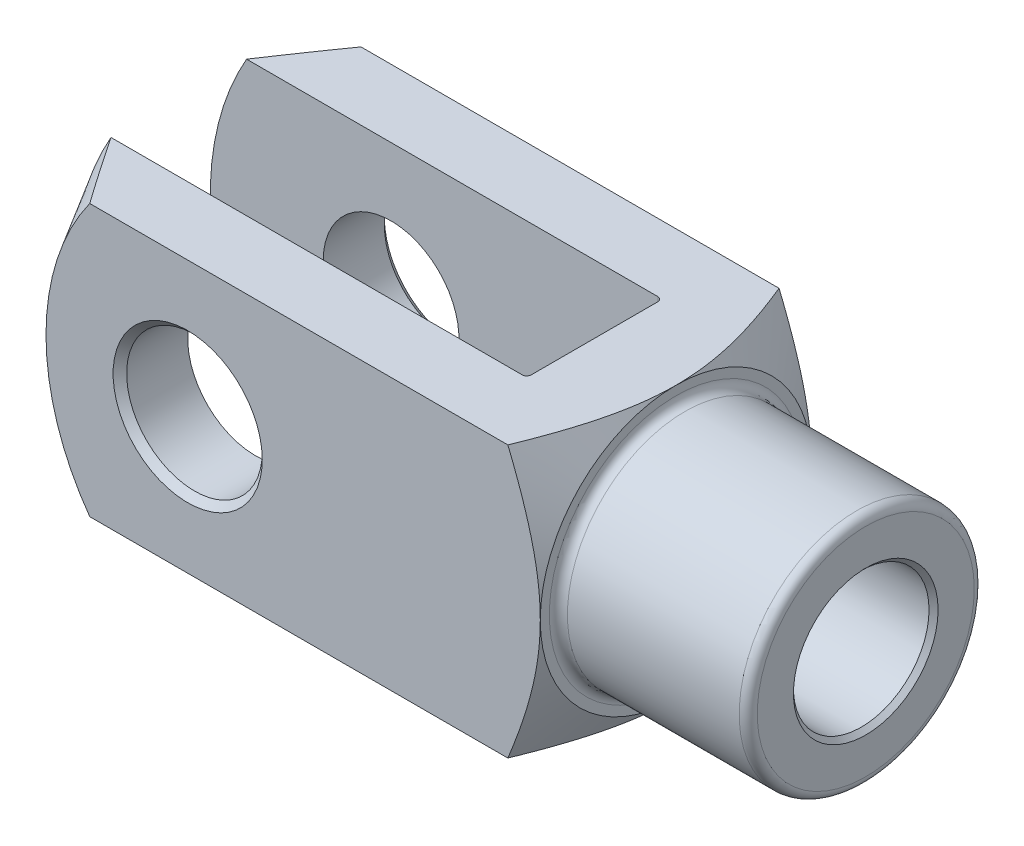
ISO-10303-21;
HEADER;
FILE_DESCRIPTION(('STEP AP214'),'2;1');
FILE_NAME('part.step','',(''),(''),'','','');
FILE_SCHEMA(('AUTOMOTIVE_DESIGN { 1 0 10303 214 1 1 1 1 }'));
ENDSEC;
DATA;
#1=APPLICATION_CONTEXT('core data for automotive mechanical design processes');
#2=APPLICATION_PROTOCOL_DEFINITION('international standard','automotive_design',2000,#1);
#3=PRODUCT_CONTEXT('',#1,'mechanical');
#4=PRODUCT('Part','Part','',(#3));
#5=PRODUCT_RELATED_PRODUCT_CATEGORY('part','',(#4));
#6=PRODUCT_DEFINITION_FORMATION('','',#4);
#7=PRODUCT_DEFINITION_CONTEXT('part definition',#1,'design');
#8=PRODUCT_DEFINITION('design','',#6,#7);
#9=PRODUCT_DEFINITION_SHAPE('','',#8);
#10=(LENGTH_UNIT() NAMED_UNIT(*) SI_UNIT(.MILLI.,.METRE.));
#11=(NAMED_UNIT(*) PLANE_ANGLE_UNIT() SI_UNIT($,.RADIAN.));
#12=(NAMED_UNIT(*) SI_UNIT($,.STERADIAN.) SOLID_ANGLE_UNIT());
#13=UNCERTAINTY_MEASURE_WITH_UNIT(LENGTH_MEASURE(1.E-05),#10,'distance_accuracy_value','');
#14=(GEOMETRIC_REPRESENTATION_CONTEXT(3) GLOBAL_UNCERTAINTY_ASSIGNED_CONTEXT((#13)) GLOBAL_UNIT_ASSIGNED_CONTEXT((#10,
#11,#12)) REPRESENTATION_CONTEXT('',''));
#15=CARTESIAN_POINT('',(0.,0.,0.));
#16=DIRECTION('',(0.,0.,1.));
#17=DIRECTION('',(1.,0.,0.));
#18=AXIS2_PLACEMENT_3D('',#15,#16,#17);
#19=CARTESIAN_POINT('',(-61.,-30.,-14.));
#20=DIRECTION('',(0.,-1.,0.));
#21=DIRECTION('',(0.,0.,-1.));
#22=AXIS2_PLACEMENT_3D('',#19,#20,#21);
#23=CYLINDRICAL_SURFACE('',#22,1.);
#24=DIRECTION('',(0.,1.,0.));
#25=VECTOR('',#24,1.);
#26=CARTESIAN_POINT('',(-60.,-30.,-14.));
#27=LINE('',#26,#25);
#28=CARTESIAN_POINT('',(-60.,-5.38516480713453,-14.));
#29=VERTEX_POINT('',#28);
#30=CARTESIAN_POINT('',(-60.,-30.,-14.));
#31=VERTEX_POINT('',#30);
#32=EDGE_CURVE('E358',#29,#31,#27,.F.);
#33=ORIENTED_EDGE('',*,*,#32,.F.);
#34=CARTESIAN_POINT('',(-60.,-5.38516480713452,-14.));
#35=CARTESIAN_POINT('',(-60.0000082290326,-5.3065422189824,-14.0302430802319));
#36=CARTESIAN_POINT('',(-60.0013709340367,-5.22767688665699,-14.0598181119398));
#37=CARTESIAN_POINT('',(-60.0065144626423,-5.06954390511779,-14.1176062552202));
#38=CARTESIAN_POINT('',(-60.0102947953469,-4.99027634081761,-14.1458196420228));
#39=CARTESIAN_POINT('',(-60.0248165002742,-4.75212047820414,-14.2283365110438));
#40=CARTESIAN_POINT('',(-60.0387398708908,-4.59270703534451,-14.2805828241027));
#41=CARTESIAN_POINT('',(-60.0732940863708,-4.27324380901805,-14.3794052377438));
#42=CARTESIAN_POINT('',(-60.0939112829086,-4.11319596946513,-14.4259926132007));
#43=CARTESIAN_POINT('',(-60.140562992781,-3.79233201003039,-14.5136450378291));
#44=CARTESIAN_POINT('',(-60.1665995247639,-3.63151562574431,-14.554708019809));
#45=CARTESIAN_POINT('',(-60.2447603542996,-3.18519590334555,-14.6608478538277));
#46=CARTESIAN_POINT('',(-60.3015289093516,-2.89908660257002,-14.7200516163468));
#47=CARTESIAN_POINT('',(-60.4241888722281,-2.32586428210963,-14.8214427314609));
#48=CARTESIAN_POINT('',(-60.4900830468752,-2.03875098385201,-14.8636249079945));
#49=CARTESIAN_POINT('',(-60.6962991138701,-1.17626175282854,-14.965008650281));
#50=CARTESIAN_POINT('',(-60.8451745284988,-0.599636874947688,-14.9990708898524));
#51=CARTESIAN_POINT('',(-60.9959175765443,-0.0158112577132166,-14.9999937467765));
#52=CARTESIAN_POINT('',(-60.9979588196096,-0.0079055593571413,-14.9999999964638));
#53=CARTESIAN_POINT('',(-61.,0.,-15.));
#54=B_SPLINE_CURVE_WITH_KNOTS('',3,(#34,#35,#36,#37,#38,#39,#40,#41,#42,#43,#44,#45,#46,#47,#48,
#49,#50,#51,#52,#53),.UNSPECIFIED.,.F.,.F.,(4,2,2,2,2,2,2,2,2,4),(0.,0.25268103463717,
0.505310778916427,1.01001851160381,1.51370356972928,2.01757658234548,2.90965687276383,
3.80200823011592,5.58640000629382,5.61089491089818),.UNSPECIFIED.);
#55=CARTESIAN_POINT('',(-61.,0.,-15.));
#56=VERTEX_POINT('',#55);
#57=EDGE_CURVE('E391',#29,#56,#54,.T.);
#58=ORIENTED_EDGE('',*,*,#57,.T.);
#59=DIRECTION('',(0.,1.,0.));
#60=VECTOR('',#59,1.);
#61=CARTESIAN_POINT('',(-61.,30.,-15.));
#62=LINE('',#61,#60);
#63=CARTESIAN_POINT('',(-61.,-30.,-15.));
#64=VERTEX_POINT('',#63);
#65=EDGE_CURVE('E183',#64,#56,#62,.T.);
#66=ORIENTED_EDGE('',*,*,#65,.F.);
#67=CARTESIAN_POINT('',(-61.,-30.,-14.));
#68=DIRECTION('',(0.,-1.,0.));
#69=DIRECTION('',(0.,0.,-1.));
#70=AXIS2_PLACEMENT_3D('',#67,#68,#69);
#71=CIRCLE('',#70,1.);
#72=EDGE_CURVE('E198',#31,#64,#71,.F.);
#73=ORIENTED_EDGE('',*,*,#72,.F.);
#74=EDGE_LOOP('',(#33,#58,#66,#73));
#75=FACE_BOUND('',#74,.T.);
#76=ADVANCED_FACE('F37',(#75),#23,.F.);
#77=CARTESIAN_POINT('',(-60.,-30.,-15.));
#78=DIRECTION('',(1.,0.,0.));
#79=DIRECTION('',(0.,0.,-1.));
#80=AXIS2_PLACEMENT_3D('',#77,#78,#79);
#81=PLANE('',#80);
#82=CARTESIAN_POINT('',(-60.,30.,-14.));
#83=VERTEX_POINT('',#82);
#84=CARTESIAN_POINT('',(-60.,5.38516480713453,-14.));
#85=VERTEX_POINT('',#84);
#86=EDGE_CURVE('E374',#83,#85,#27,.F.);
#87=ORIENTED_EDGE('',*,*,#86,.T.);
#88=CARTESIAN_POINT('',(-60.,0.,0.));
#89=DIRECTION('',(1.,0.,0.));
#90=DIRECTION('',(0.,0.,-1.));
#91=AXIS2_PLACEMENT_3D('',#88,#89,#90);
#92=CIRCLE('',#91,15.);
#93=CARTESIAN_POINT('',(-60.,5.38516480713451,14.));
#94=VERTEX_POINT('',#93);
#95=EDGE_CURVE('E423',#85,#94,#92,.T.);
#96=ORIENTED_EDGE('',*,*,#95,.T.);
#97=DIRECTION('',(0.,1.,0.));
#98=VECTOR('',#97,1.);
#99=CARTESIAN_POINT('',(-60.,30.,14.));
#100=LINE('',#99,#98);
#101=CARTESIAN_POINT('',(-60.,30.,14.));
#102=VERTEX_POINT('',#101);
#103=EDGE_CURVE('E160',#94,#102,#100,.T.);
#104=ORIENTED_EDGE('',*,*,#103,.T.);
#105=DIRECTION('',(0.,0.,-1.));
#106=VECTOR('',#105,1.);
#107=CARTESIAN_POINT('',(-60.,30.,-15.));
#108=LINE('',#107,#106);
#109=EDGE_CURVE('E338',#102,#83,#108,.T.);
#110=ORIENTED_EDGE('',*,*,#109,.T.);
#111=EDGE_LOOP('',(#87,#96,#104,#110));
#112=FACE_BOUND('',#111,.T.);
#113=ADVANCED_FACE('F496',(#112),#81,.F.);
#114=CARTESIAN_POINT('',(-61.,-30.,14.));
#115=DIRECTION('',(0.,-1.,0.));
#116=DIRECTION('',(0.,0.,-1.));
#117=AXIS2_PLACEMENT_3D('',#114,#115,#116);
#118=CYLINDRICAL_SURFACE('',#117,1.);
#119=ORIENTED_EDGE('',*,*,#103,.F.);
#120=CARTESIAN_POINT('',(-60.,5.38516480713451,14.));
#121=CARTESIAN_POINT('',(-60.0000082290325,5.30654221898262,14.0302430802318));
#122=CARTESIAN_POINT('',(-60.0013709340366,5.22767688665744,14.0598181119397));
#123=CARTESIAN_POINT('',(-60.0065144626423,5.06954390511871,14.1176062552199));
#124=CARTESIAN_POINT('',(-60.0102947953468,4.99027634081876,14.1458196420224));
#125=CARTESIAN_POINT('',(-60.0248165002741,4.75212047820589,14.2283365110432));
#126=CARTESIAN_POINT('',(-60.0387398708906,4.59270703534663,14.280582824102));
#127=CARTESIAN_POINT('',(-60.0732940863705,4.2732438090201,14.3794052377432));
#128=CARTESIAN_POINT('',(-60.0939112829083,4.11319596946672,14.4259926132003));
#129=CARTESIAN_POINT('',(-60.1405629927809,3.79233201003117,14.5136450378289));
#130=CARTESIAN_POINT('',(-60.1665995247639,3.63151562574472,14.5547080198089));
#131=CARTESIAN_POINT('',(-60.2447603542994,3.18519590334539,14.6608478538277));
#132=CARTESIAN_POINT('',(-60.3015289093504,2.89908660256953,14.7200516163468));
#133=CARTESIAN_POINT('',(-60.4241888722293,2.3258642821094,14.821442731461));
#134=CARTESIAN_POINT('',(-60.4900830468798,2.03875098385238,14.8636249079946));
#135=CARTESIAN_POINT('',(-60.6962991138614,1.17626175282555,14.965008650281));
#136=CARTESIAN_POINT('',(-60.8451745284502,0.599636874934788,14.9990708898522));
#137=CARTESIAN_POINT('',(-60.995917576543,0.0158112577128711,14.9999937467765));
#138=CARTESIAN_POINT('',(-60.9979588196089,0.00790555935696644,14.9999999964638));
#139=CARTESIAN_POINT('',(-61.,0.,15.));
#140=B_SPLINE_CURVE_WITH_KNOTS('',3,(#120,#121,#122,#123,#124,#125,#126,#127,#128,#129,#130,
#131,#132,#133,#134,#135,#136,#137,#138,#139),.UNSPECIFIED.,.F.,.F.,(4,2,2,2,2,2,2,2,2,4),(0.,
0.25268103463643,0.505310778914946,1.01001851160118,1.51370356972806,2.01757658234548,
2.90965687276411,3.80200823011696,5.58640000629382,5.61089491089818),.UNSPECIFIED.);
#141=CARTESIAN_POINT('',(-61.,0.,15.));
#142=VERTEX_POINT('',#141);
#143=EDGE_CURVE('E145',#94,#142,#140,.T.);
#144=ORIENTED_EDGE('',*,*,#143,.T.);
#145=DIRECTION('',(0.,1.,0.));
#146=VECTOR('',#145,1.);
#147=CARTESIAN_POINT('',(-61.,-30.,15.));
#148=LINE('',#147,#146);
#149=CARTESIAN_POINT('',(-61.,30.,15.));
#150=VERTEX_POINT('',#149);
#151=EDGE_CURVE('E159',#150,#142,#148,.F.);
#152=ORIENTED_EDGE('',*,*,#151,.F.);
#153=CARTESIAN_POINT('',(-61.,30.,14.));
#154=DIRECTION('',(0.,1.,0.));
#155=DIRECTION('',(0.,0.,1.));
#156=AXIS2_PLACEMENT_3D('',#153,#154,#155);
#157=CIRCLE('',#156,1.);
#158=EDGE_CURVE('E190',#102,#150,#157,.F.);
#159=ORIENTED_EDGE('',*,*,#158,.F.);
#160=EDGE_LOOP('',(#119,#144,#152,#159));
#161=FACE_BOUND('',#160,.T.);
#162=ADVANCED_FACE('F156',(#161),#118,.F.);
#163=CARTESIAN_POINT('',(-160.,-30.,-15.));
#164=DIRECTION('',(0.,0.,-1.));
#165=DIRECTION('',(-1.,0.,0.));
#166=AXIS2_PLACEMENT_3D('',#163,#164,#165);
#167=PLANE('',#166);
#168=CARTESIAN_POINT('',(-120.,0.,-15.));
#169=DIRECTION('',(0.,0.,-1.));
#170=DIRECTION('',(-1.,0.,0.));
#171=AXIS2_PLACEMENT_3D('',#168,#169,#170);
#172=CIRCLE('',#171,15.);
#173=CARTESIAN_POINT('',(-135.,0.,-15.));
#174=VERTEX_POINT('',#173);
#175=EDGE_CURVE('E368',#174,#174,#172,.F.);
#176=ORIENTED_EDGE('',*,*,#175,.F.);
#177=EDGE_LOOP('',(#176));
#178=FACE_BOUND('',#177,.T.);
#179=CARTESIAN_POINT('',(-100.,0.,-15.));
#180=DIRECTION('',(0.,0.,1.));
#181=DIRECTION('',(1.,0.,0.));
#182=AXIS2_PLACEMENT_3D('',#179,#180,#181);
#183=CIRCLE('',#182,60.);
#184=CARTESIAN_POINT('',(-151.961524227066,30.,-15.));
#185=VERTEX_POINT('',#184);
#186=CARTESIAN_POINT('',(-151.961524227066,-30.,-15.));
#187=VERTEX_POINT('',#186);
#188=EDGE_CURVE('E276',#185,#187,#183,.T.);
#189=ORIENTED_EDGE('',*,*,#188,.T.);
#190=DIRECTION('',(-1.,0.,0.));
#191=VECTOR('',#190,1.);
#192=CARTESIAN_POINT('',(-160.,-30.,-15.));
#193=LINE('',#192,#191);
#194=EDGE_CURVE('E333',#64,#187,#193,.T.);
#195=ORIENTED_EDGE('',*,*,#194,.F.);
#196=ORIENTED_EDGE('',*,*,#65,.T.);
#197=CARTESIAN_POINT('',(-61.,30.,-15.));
#198=VERTEX_POINT('',#197);
#199=EDGE_CURVE('E179',#56,#198,#62,.T.);
#200=ORIENTED_EDGE('',*,*,#199,.T.);
#201=DIRECTION('',(-1.,0.,0.));
#202=VECTOR('',#201,1.);
#203=CARTESIAN_POINT('',(-160.,30.,-15.));
#204=LINE('',#203,#202);
#205=EDGE_CURVE('E346',#198,#185,#204,.T.);
#206=ORIENTED_EDGE('',*,*,#205,.T.);
#207=EDGE_LOOP('',(#189,#195,#196,#200,#206));
#208=FACE_BOUND('',#207,.T.);
#209=ADVANCED_FACE('F394',(#178,#208),#167,.F.);
#210=CARTESIAN_POINT('',(-160.,-30.,15.));
#211=DIRECTION('',(0.,0.,1.));
#212=DIRECTION('',(1.,0.,0.));
#213=AXIS2_PLACEMENT_3D('',#210,#211,#212);
#214=PLANE('',#213);
#215=CARTESIAN_POINT('',(-120.,0.,15.));
#216=DIRECTION('',(0.,0.,1.));
#217=DIRECTION('',(1.,0.,0.));
#218=AXIS2_PLACEMENT_3D('',#215,#216,#217);
#219=CIRCLE('',#218,15.);
#220=CARTESIAN_POINT('',(-105.,0.,15.));
#221=VERTEX_POINT('',#220);
#222=EDGE_CURVE('E345',#221,#221,#219,.F.);
#223=ORIENTED_EDGE('',*,*,#222,.F.);
#224=EDGE_LOOP('',(#223));
#225=FACE_BOUND('',#224,.T.);
#226=DIRECTION('',(1.,0.,0.));
#227=VECTOR('',#226,1.);
#228=CARTESIAN_POINT('',(-160.,-30.,15.));
#229=LINE('',#228,#227);
#230=CARTESIAN_POINT('',(-151.961524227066,-30.,15.));
#231=VERTEX_POINT('',#230);
#232=CARTESIAN_POINT('',(-61.,-30.,15.));
#233=VERTEX_POINT('',#232);
#234=EDGE_CURVE('E337',#231,#233,#229,.T.);
#235=ORIENTED_EDGE('',*,*,#234,.F.);
#236=CARTESIAN_POINT('',(-100.,0.,15.));
#237=DIRECTION('',(0.,0.,1.));
#238=DIRECTION('',(1.,0.,0.));
#239=AXIS2_PLACEMENT_3D('',#236,#237,#238);
#240=CIRCLE('',#239,60.);
#241=CARTESIAN_POINT('',(-151.961524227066,30.,15.));
#242=VERTEX_POINT('',#241);
#243=EDGE_CURVE('E420',#242,#231,#240,.T.);
#244=ORIENTED_EDGE('',*,*,#243,.F.);
#245=DIRECTION('',(1.,0.,0.));
#246=VECTOR('',#245,1.);
#247=CARTESIAN_POINT('',(-160.,30.,15.));
#248=LINE('',#247,#246);
#249=EDGE_CURVE('E176',#242,#150,#248,.T.);
#250=ORIENTED_EDGE('',*,*,#249,.T.);
#251=ORIENTED_EDGE('',*,*,#151,.T.);
#252=EDGE_CURVE('E164',#142,#233,#148,.F.);
#253=ORIENTED_EDGE('',*,*,#252,.T.);
#254=EDGE_LOOP('',(#235,#244,#250,#251,#253));
#255=FACE_BOUND('',#254,.T.);
#256=ADVANCED_FACE('F173',(#225,#255),#214,.F.);
#257=CARTESIAN_POINT('',(-160.,-30.,30.));
#258=DIRECTION('',(0.,0.,1.));
#259=DIRECTION('',(1.,0.,0.));
#260=AXIS2_PLACEMENT_3D('',#257,#258,#259);
#261=PLANE('',#260);
#262=CARTESIAN_POINT('',(-120.,0.,30.));
#263=DIRECTION('',(0.,0.,1.));
#264=DIRECTION('',(1.,0.,0.));
#265=AXIS2_PLACEMENT_3D('',#262,#263,#264);
#266=CIRCLE('',#265,16.5);
#267=CARTESIAN_POINT('',(-103.5,0.,30.));
#268=VERTEX_POINT('',#267);
#269=EDGE_CURVE('E228',#268,#268,#266,.F.);
#270=ORIENTED_EDGE('',*,*,#269,.T.);
#271=EDGE_LOOP('',(#270));
#272=FACE_BOUND('',#271,.T.);
#273=DIRECTION('',(1.,0.,0.));
#274=VECTOR('',#273,1.);
#275=CARTESIAN_POINT('',(-160.,30.,30.));
#276=LINE('',#275,#274);
#277=CARTESIAN_POINT('',(-141.662567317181,30.,30.));
#278=VERTEX_POINT('',#277);
#279=CARTESIAN_POINT('',(-49.1743893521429,30.,30.));
#280=VERTEX_POINT('',#279);
#281=EDGE_CURVE('E365',#278,#280,#276,.T.);
#282=ORIENTED_EDGE('',*,*,#281,.F.);
#283=CARTESIAN_POINT('',(-100.,0.,30.));
#284=DIRECTION('',(0.,0.,1.));
#285=DIRECTION('',(1.,0.,0.));
#286=AXIS2_PLACEMENT_3D('',#283,#284,#285);
#287=CIRCLE('',#286,51.3397459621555);
#288=CARTESIAN_POINT('',(-141.662567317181,-30.,30.));
#289=VERTEX_POINT('',#288);
#290=EDGE_CURVE('E61',#278,#289,#287,.T.);
#291=ORIENTED_EDGE('',*,*,#290,.T.);
#292=DIRECTION('',(1.,0.,0.));
#293=VECTOR('',#292,1.);
#294=CARTESIAN_POINT('',(-160.,-30.,30.));
#295=LINE('',#294,#293);
#296=CARTESIAN_POINT('',(-49.1743893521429,-30.,30.));
#297=VERTEX_POINT('',#296);
#298=EDGE_CURVE('E362',#289,#297,#295,.T.);
#299=ORIENTED_EDGE('',*,*,#298,.T.);
#300=CARTESIAN_POINT('',(-64.0676203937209,-61.2721306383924,30.));
#301=CARTESIAN_POINT('',(-63.6842875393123,-60.532858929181,30.));
#302=CARTESIAN_POINT('',(-63.3020053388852,-59.7930426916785,30.));
#303=CARTESIAN_POINT('',(-62.5397668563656,-58.3122101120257,30.));
#304=CARTESIAN_POINT('',(-62.1598105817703,-57.5711937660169,30.));
#305=CARTESIAN_POINT('',(-61.0237330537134,-55.3461103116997,30.));
#306=CARTESIAN_POINT('',(-60.271441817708,-53.8600833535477,30.));
#307=CARTESIAN_POINT('',(-58.778071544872,-50.8791629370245,30.));
#308=CARTESIAN_POINT('',(-58.0370143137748,-49.3842585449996,30.));
#309=CARTESIAN_POINT('',(-56.5704770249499,-46.3868393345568,30.));
#310=CARTESIAN_POINT('',(-55.8449966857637,-44.8843246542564,30.));
#311=CARTESIAN_POINT('',(-54.7494739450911,-42.5771971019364,30.));
#312=CARTESIAN_POINT('',(-54.3723843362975,-41.775928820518,30.));
#313=CARTESIAN_POINT('',(-53.6245018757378,-40.1704608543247,30.));
#314=CARTESIAN_POINT('',(-53.2537089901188,-39.366261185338,30.));
#315=CARTESIAN_POINT('',(-52.5192756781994,-37.7545431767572,30.));
#316=CARTESIAN_POINT('',(-52.1556356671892,-36.9470246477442,30.));
#317=CARTESIAN_POINT('',(-51.4365698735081,-35.3283308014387,30.));
#318=CARTESIAN_POINT('',(-51.0811441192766,-34.5171554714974,30.));
#319=CARTESIAN_POINT('',(-50.3798881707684,-32.8910810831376,30.));
#320=CARTESIAN_POINT('',(-50.034053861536,-32.0761838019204,30.));
#321=CARTESIAN_POINT('',(-49.3532732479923,-30.441856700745,30.));
#322=CARTESIAN_POINT('',(-49.0183268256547,-29.6224269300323,30.));
#323=CARTESIAN_POINT('',(-48.3610698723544,-27.9786160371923,30.));
#324=CARTESIAN_POINT('',(-48.0387578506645,-27.154235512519,30.));
#325=CARTESIAN_POINT('',(-47.4087417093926,-25.4998606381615,30.));
#326=CARTESIAN_POINT('',(-47.1010382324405,-24.669866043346,30.));
#327=CARTESIAN_POINT('',(-46.4377423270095,-22.8231172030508,30.));
#328=CARTESIAN_POINT('',(-46.0862317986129,-21.8048880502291,30.));
#329=CARTESIAN_POINT('',(-45.4134595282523,-19.7585295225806,30.));
#330=CARTESIAN_POINT('',(-45.0921951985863,-18.7304010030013,30.));
#331=CARTESIAN_POINT('',(-44.4858787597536,-16.6634632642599,30.));
#332=CARTESIAN_POINT('',(-44.2008258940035,-15.6246542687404,30.));
#333=CARTESIAN_POINT('',(-43.6737396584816,-13.5361087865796,30.));
#334=CARTESIAN_POINT('',(-43.4317058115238,-12.4863724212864,30.));
#335=CARTESIAN_POINT('',(-43.0030483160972,-10.4011527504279,30.));
#336=CARTESIAN_POINT('',(-42.815257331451,-9.36591330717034,30.));
#337=CARTESIAN_POINT('',(-42.5745074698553,-7.80678497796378,30.));
#338=CARTESIAN_POINT('',(-42.501078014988,-7.28600821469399,30.));
#339=CARTESIAN_POINT('',(-42.3685816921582,-6.24263916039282,30.));
#340=CARTESIAN_POINT('',(-42.30951415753,-5.72004695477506,30.));
#341=CARTESIAN_POINT('',(-42.2064028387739,-4.67369371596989,30.));
#342=CARTESIAN_POINT('',(-42.1623501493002,-4.14993356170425,30.));
#343=CARTESIAN_POINT('',(-42.0897145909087,-3.10136165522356,30.));
#344=CARTESIAN_POINT('',(-42.0611310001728,-2.57654995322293,30.));
#345=CARTESIAN_POINT('',(-42.0197643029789,-1.52630334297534,30.));
#346=CARTESIAN_POINT('',(-42.0069811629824,-1.00086843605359,30.));
#347=CARTESIAN_POINT('',(-41.9973673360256,0.0501448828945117,30.));
#348=CARTESIAN_POINT('',(-42.000536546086,0.575723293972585,30.));
#349=CARTESIAN_POINT('',(-42.0219788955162,1.58823940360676,30.));
#350=CARTESIAN_POINT('',(-42.0391341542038,2.0752009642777,30.));
#351=CARTESIAN_POINT('',(-42.0869412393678,3.04846603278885,30.));
#352=CARTESIAN_POINT('',(-42.1175935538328,3.53476951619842,30.));
#353=CARTESIAN_POINT('',(-42.22937419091,4.99210807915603,30.));
#354=CARTESIAN_POINT('',(-42.3303287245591,5.96168473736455,30.));
#355=CARTESIAN_POINT('',(-42.5814462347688,7.89482523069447,30.));
#356=CARTESIAN_POINT('',(-42.7316346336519,8.85838569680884,30.));
#357=CARTESIAN_POINT('',(-43.0762587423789,10.7775257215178,30.));
#358=CARTESIAN_POINT('',(-43.2706956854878,11.7331050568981,30.));
#359=CARTESIAN_POINT('',(-43.7046000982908,13.6629858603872,30.));
#360=CARTESIAN_POINT('',(-43.945208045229,14.6370286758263,30.));
#361=CARTESIAN_POINT('',(-44.4617458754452,16.575659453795,30.));
#362=CARTESIAN_POINT('',(-44.7376760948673,17.5402473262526,30.));
#363=CARTESIAN_POINT('',(-45.1740597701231,18.9802177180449,30.));
#364=CARTESIAN_POINT('',(-45.3232675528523,19.4590515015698,30.));
#365=CARTESIAN_POINT('',(-45.6285897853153,20.4145158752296,30.));
#366=CARTESIAN_POINT('',(-45.7847042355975,20.8911464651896,30.));
#367=CARTESIAN_POINT('',(-46.1032635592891,21.8422529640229,30.));
#368=CARTESIAN_POINT('',(-46.2657080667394,22.3167289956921,30.));
#369=CARTESIAN_POINT('',(-46.5964184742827,23.2636425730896,30.));
#370=CARTESIAN_POINT('',(-46.7646843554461,23.736080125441,30.));
#371=CARTESIAN_POINT('',(-47.3053438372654,25.2273271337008,30.));
#372=CARTESIAN_POINT('',(-47.6875549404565,26.2425868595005,30.));
#373=CARTESIAN_POINT('',(-48.4727290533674,28.2650739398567,30.));
#374=CARTESIAN_POINT('',(-48.8756933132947,29.2723008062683,30.));
#375=CARTESIAN_POINT('',(-49.6990231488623,31.2798668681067,30.));
#376=CARTESIAN_POINT('',(-50.1193926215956,32.2802044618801,30.));
#377=CARTESIAN_POINT('',(-50.9746371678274,34.27462207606,30.));
#378=CARTESIAN_POINT('',(-51.4095119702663,35.2687022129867,30.));
#379=CARTESIAN_POINT('',(-52.2918767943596,37.2522665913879,30.));
#380=CARTESIAN_POINT('',(-52.7393773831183,38.2417461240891,30.));
#381=CARTESIAN_POINT('',(-53.6447705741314,40.2159368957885,30.));
#382=CARTESIAN_POINT('',(-54.1026632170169,41.2006481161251,30.));
#383=CARTESIAN_POINT('',(-55.0272585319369,43.1657850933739,30.));
#384=CARTESIAN_POINT('',(-55.4939602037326,44.1462113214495,30.));
#385=CARTESIAN_POINT('',(-56.4349656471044,46.1034032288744,30.));
#386=CARTESIAN_POINT('',(-56.9092694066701,47.0801689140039,30.));
#387=CARTESIAN_POINT('',(-57.8658912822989,49.0334543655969,30.));
#388=CARTESIAN_POINT('',(-58.348229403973,50.0099643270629,30.));
#389=CARTESIAN_POINT('',(-59.3186378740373,51.9601333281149,30.));
#390=CARTESIAN_POINT('',(-59.8067082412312,52.9337923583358,30.));
#391=CARTESIAN_POINT('',(-61.2784040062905,55.8510345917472,30.));
#392=CARTESIAN_POINT('',(-62.269498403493,57.7908510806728,30.));
#393=CARTESIAN_POINT('',(-64.2665281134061,61.6615986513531,30.));
#394=CARTESIAN_POINT('',(-65.2724558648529,63.5925336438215,30.));
#395=CARTESIAN_POINT('',(-67.2963715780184,67.4480486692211,30.));
#396=CARTESIAN_POINT('',(-68.3143594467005,69.3726287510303,30.));
#397=CARTESIAN_POINT('',(-70.2080902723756,72.9312133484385,30.));
#398=CARTESIAN_POINT('',(-71.082506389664,74.565924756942,30.));
#399=CARTESIAN_POINT('',(-72.8371969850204,77.8322019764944,30.));
#400=CARTESIAN_POINT('',(-73.7174714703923,79.4637677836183,30.));
#401=CARTESIAN_POINT('',(-75.4830843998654,82.7244516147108,30.));
#402=CARTESIAN_POINT('',(-76.3684235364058,84.3535692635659,30.));
#403=CARTESIAN_POINT('',(-78.1433082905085,87.6095117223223,30.));
#404=CARTESIAN_POINT('',(-79.0328539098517,89.2363365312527,30.));
#405=CARTESIAN_POINT('',(-80.8104465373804,92.4786949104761,30.));
#406=CARTESIAN_POINT('',(-81.6984729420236,94.094239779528,30.));
#407=CARTESIAN_POINT('',(-83.47760977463,97.3236307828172,30.));
#408=CARTESIAN_POINT('',(-84.3687202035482,98.9374769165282,30.));
#409=CARTESIAN_POINT('',(-86.1534802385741,102.163431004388,30.));
#410=CARTESIAN_POINT('',(-87.0471294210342,103.775539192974,30.));
#411=CARTESIAN_POINT('',(-88.8367829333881,106.998445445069,30.));
#412=CARTESIAN_POINT('',(-89.7327872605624,108.609243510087,30.));
#413=CARTESIAN_POINT('',(-90.6298080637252,110.219474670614,30.));
#414=B_SPLINE_CURVE_WITH_KNOTS('',3,(#300,#301,#302,#303,#304,#305,#306,#307,#308,#309,#310,
#311,#312,#313,#314,#315,#316,#317,#318,#319,#320,#321,#322,#323,#324,#325,#326,#327,#328,#329,
#330,#331,#332,#333,#334,#335,#336,#337,#338,#339,#340,#341,#342,#343,#344,#345,#346,#347,#348,
#349,#350,#351,#352,#353,#354,#355,#356,#357,#358,#359,#360,#361,#362,#363,#364,#365,#366,#367,
#368,#369,#370,#371,#372,#373,#374,#375,#376,#377,#378,#379,#380,#381,#382,#383,#384,#385,#386,
#387,#388,#389,#390,#391,#392,#393,#394,#395,#396,#397,#398,#399,#400,#401,#402,#403,#404,#405,
#406,#407,#408,#409,#410,#411,#412,#413),.UNSPECIFIED.,.F.,.F.,(4,2,2,2,2,2,2,2,2,2,2,2,2,2,2,2,
2,2,2,2,2,2,2,2,2,2,2,2,2,2,2,2,2,2,2,2,2,2,2,2,2,2,2,2,2,2,2,2,2,2,2,2,2,2,2,2,4),(0.,
2.49823775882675,4.99648356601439,9.99322723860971,14.9986720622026,20.0040263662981,
22.6607028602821,25.3173650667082,27.974181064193,30.6310062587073,33.2866734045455,
35.942311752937,38.5976358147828,41.2530765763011,44.4842625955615,47.715171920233,
50.9460137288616,54.1768196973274,57.3317853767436,58.9094034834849,60.4869483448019,
62.0635559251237,63.6400899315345,65.2166205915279,66.7931410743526,68.254737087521,
69.7163859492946,72.6393436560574,75.5638130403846,78.4883639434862,81.4975634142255,
84.5067915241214,86.0113774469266,87.5159634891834,89.0204626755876,90.5249569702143,
93.7791124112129,97.0334641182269,100.28854846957,103.543572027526,106.801405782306,
110.059252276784,113.316731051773,116.574204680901,119.841597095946,123.109000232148,
129.643912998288,136.175602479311,142.707241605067,148.268879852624,153.830525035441,
159.392949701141,164.955376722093,170.485941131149,176.01650725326,181.54619913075,
187.075884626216),.UNSPECIFIED.);
#415=CARTESIAN_POINT('',(-42.,0.,30.));
#416=VERTEX_POINT('',#415);
#417=EDGE_CURVE('E305',#416,#297,#414,.F.);
#418=ORIENTED_EDGE('',*,*,#417,.F.);
#419=EDGE_CURVE('E303',#280,#416,#414,.F.);
#420=ORIENTED_EDGE('',*,*,#419,.F.);
#421=EDGE_LOOP('',(#282,#291,#299,#418,#420));
#422=FACE_BOUND('',#421,.T.);
#423=ADVANCED_FACE('F287',(#272,#422),#261,.T.);
#424=CARTESIAN_POINT('',(-160.,-30.,30.));
#425=DIRECTION('',(0.,-1.,0.));
#426=DIRECTION('',(0.,0.,-1.));
#427=AXIS2_PLACEMENT_3D('',#424,#425,#426);
#428=PLANE('',#427);
#429=ORIENTED_EDGE('',*,*,#194,.T.);
#430=CARTESIAN_POINT('',(-175.69632116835,-30.,22.1081506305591));
#431=CARTESIAN_POINT('',(-174.966529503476,-30.,20.933043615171));
#432=CARTESIAN_POINT('',(-174.235709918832,-30.,19.7585749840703));
#433=CARTESIAN_POINT('',(-172.77182047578,-30.,17.411040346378));
#434=CARTESIAN_POINT('',(-172.038750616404,-30.,16.2379743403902));
#435=CARTESIAN_POINT('',(-169.835846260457,-30.,12.7210248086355));
#436=CARTESIAN_POINT('',(-168.362345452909,-30.,10.3794356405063));
#437=CARTESIAN_POINT('',(-165.401888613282,-30.,5.70085627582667));
#438=CARTESIAN_POINT('',(-163.914918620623,-30.,3.36387490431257));
#439=CARTESIAN_POINT('',(-161.673801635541,-30.,-0.134747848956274));
#440=CARTESIAN_POINT('',(-160.924989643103,-30.,-1.29980771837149));
#441=CARTESIAN_POINT('',(-159.423412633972,-30.,-3.62738958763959));
#442=CARTESIAN_POINT('',(-158.670647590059,-30.,-4.78991156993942));
#443=CARTESIAN_POINT('',(-157.129308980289,-30.,-7.16043682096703));
#444=CARTESIAN_POINT('',(-156.340549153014,-30.,-8.36831902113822));
#445=CARTESIAN_POINT('',(-154.757698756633,-30.,-10.7805852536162));
#446=CARTESIAN_POINT('',(-153.963608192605,-30.,-11.9849692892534));
#447=CARTESIAN_POINT('',(-152.369428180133,-30.,-14.3897492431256));
#448=CARTESIAN_POINT('',(-151.569338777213,-30.,-15.5901451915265));
#449=CARTESIAN_POINT('',(-149.962363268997,-30.,-17.9863760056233));
#450=CARTESIAN_POINT('',(-149.155477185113,-30.,-19.1822108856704));
#451=CARTESIAN_POINT('',(-147.534559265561,-30.,-21.5677433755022));
#452=CARTESIAN_POINT('',(-146.720533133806,-30.,-22.7574448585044));
#453=CARTESIAN_POINT('',(-145.083618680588,-30.,-25.1307438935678));
#454=CARTESIAN_POINT('',(-144.260730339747,-30.,-26.3143414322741));
#455=CARTESIAN_POINT('',(-142.604766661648,-30.,-28.6743145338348));
#456=CARTESIAN_POINT('',(-141.771691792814,-30.,-29.8506904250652));
#457=CARTESIAN_POINT('',(-140.093661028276,-30.,-32.1949287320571));
#458=CARTESIAN_POINT('',(-139.24870525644,-30.,-33.3627912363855));
#459=CARTESIAN_POINT('',(-137.552785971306,-30.,-35.6774790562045));
#460=CARTESIAN_POINT('',(-136.701951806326,-30.,-36.8243989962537));
#461=CARTESIAN_POINT('',(-134.984083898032,-30.,-39.1060929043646));
#462=CARTESIAN_POINT('',(-134.117049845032,-30.,-40.2408666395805));
#463=CARTESIAN_POINT('',(-132.362443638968,-30.,-42.4969804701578));
#464=CARTESIAN_POINT('',(-131.474844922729,-30.,-43.6182999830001));
#465=CARTESIAN_POINT('',(-130.125884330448,-30.,-45.2860308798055));
#466=CARTESIAN_POINT('',(-129.673310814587,-30.,-45.8395580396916));
#467=CARTESIAN_POINT('',(-128.761672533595,-30.,-46.9412368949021));
#468=CARTESIAN_POINT('',(-128.30260784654,-30.,-47.4893886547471));
#469=CARTESIAN_POINT('',(-127.382070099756,-30.,-48.5739517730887));
#470=CARTESIAN_POINT('',(-126.920671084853,-30.,-49.1104259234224));
#471=CARTESIAN_POINT('',(-125.990051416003,-30.,-50.1765367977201));
#472=CARTESIAN_POINT('',(-125.520830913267,-30.,-50.7061736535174));
#473=CARTESIAN_POINT('',(-124.573526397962,-30.,-51.7577460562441));
#474=CARTESIAN_POINT('',(-124.095439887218,-30.,-52.2796793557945));
#475=CARTESIAN_POINT('',(-123.12950421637,-30.,-53.3144382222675));
#476=CARTESIAN_POINT('',(-122.641655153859,-30.,-53.8272638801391));
#477=CARTESIAN_POINT('',(-121.656102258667,-30.,-54.8411494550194));
#478=CARTESIAN_POINT('',(-121.158422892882,-30.,-55.3422331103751));
#479=CARTESIAN_POINT('',(-120.150771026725,-30.,-56.3319631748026));
#480=CARTESIAN_POINT('',(-119.640797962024,-30.,-56.8206090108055));
#481=CARTESIAN_POINT('',(-118.607319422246,-30.,-57.7828189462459));
#482=CARTESIAN_POINT('',(-118.083821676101,-30.,-58.2563913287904));
#483=CARTESIAN_POINT('',(-117.021319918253,-30.,-59.1857484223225));
#484=CARTESIAN_POINT('',(-116.482318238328,-30.,-59.6415357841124));
#485=CARTESIAN_POINT('',(-115.650944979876,-30.,-60.3170047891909));
#486=CARTESIAN_POINT('',(-115.364961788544,-30.,-60.5445684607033));
#487=CARTESIAN_POINT('',(-114.788008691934,-30.,-60.9932962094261));
#488=CARTESIAN_POINT('',(-114.497038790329,-30.,-61.2144602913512));
#489=CARTESIAN_POINT('',(-113.909756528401,-30.,-61.6497334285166));
#490=CARTESIAN_POINT('',(-113.613442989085,-30.,-61.8638408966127));
#491=CARTESIAN_POINT('',(-113.015258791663,-30.,-62.2841325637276));
#492=CARTESIAN_POINT('',(-112.713388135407,-30.,-62.4903167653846));
#493=CARTESIAN_POINT('',(-111.79947605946,-30.,-63.0953537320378));
#494=CARTESIAN_POINT('',(-111.178620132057,-30.,-63.4810758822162));
#495=CARTESIAN_POINT('',(-109.911717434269,-30.,-64.2087365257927));
#496=CARTESIAN_POINT('',(-109.26567730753,-30.,-64.5506864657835));
#497=CARTESIAN_POINT('',(-108.097990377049,-30.,-65.108406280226));
#498=CARTESIAN_POINT('',(-107.581607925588,-30.,-65.3351618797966));
#499=CARTESIAN_POINT('',(-106.533725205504,-30.,-65.750793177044));
#500=CARTESIAN_POINT('',(-106.002226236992,-30.,-65.9396721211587));
#501=CARTESIAN_POINT('',(-104.926311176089,-30.,-66.2735757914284));
#502=CARTESIAN_POINT('',(-104.381914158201,-30.,-66.418661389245));
#503=CARTESIAN_POINT('',(-103.282303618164,-30.,-66.6599753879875));
#504=CARTESIAN_POINT('',(-102.727090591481,-30.,-66.7562060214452));
#505=CARTESIAN_POINT('',(-101.604376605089,-30.,-66.8963942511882));
#506=CARTESIAN_POINT('',(-101.036808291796,-30.,-66.9398196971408));
#507=CARTESIAN_POINT('',(-99.9001598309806,-30.,-66.9705580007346));
#508=CARTESIAN_POINT('',(-99.3310797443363,-30.,-66.9578730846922));
#509=CARTESIAN_POINT('',(-98.19680753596,-30.,-66.8770031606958));
#510=CARTESIAN_POINT('',(-97.6316162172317,-30.,-66.8088070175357));
#511=CARTESIAN_POINT('',(-96.5100862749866,-30.,-66.6200549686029));
#512=CARTESIAN_POINT('',(-95.9537490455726,-30.,-66.4994909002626));
#513=CARTESIAN_POINT('',(-94.7516549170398,-30.,-66.1841691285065));
#514=CARTESIAN_POINT('',(-94.1084281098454,-30.,-65.9798037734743));
#515=CARTESIAN_POINT('',(-92.8430678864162,-30.,-65.5140934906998));
#516=CARTESIAN_POINT('',(-92.2209409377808,-30.,-65.2527312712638));
#517=CARTESIAN_POINT('',(-90.9970720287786,-30.,-64.6818034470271));
#518=CARTESIAN_POINT('',(-90.3953980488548,-30.,-64.3720932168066));
#519=CARTESIAN_POINT('',(-89.5094521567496,-30.,-63.8783361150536));
#520=CARTESIAN_POINT('',(-89.2168991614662,-30.,-63.7088860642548));
#521=CARTESIAN_POINT('',(-88.6370852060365,-30.,-63.3611393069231));
#522=CARTESIAN_POINT('',(-88.3498243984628,-30.,-63.1828423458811));
#523=CARTESIAN_POINT('',(-87.3090487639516,-30.,-62.5165051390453));
#524=CARTESIAN_POINT('',(-86.5709065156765,-30.,-62.0043202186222));
#525=CARTESIAN_POINT('',(-85.1263383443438,-30.,-60.9368688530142));
#526=CARTESIAN_POINT('',(-84.4199291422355,-30.,-60.3815801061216));
#527=CARTESIAN_POINT('',(-83.0334534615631,-30.,-59.2365720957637));
#528=CARTESIAN_POINT('',(-82.3534399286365,-30.,-58.6467890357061));
#529=CARTESIAN_POINT('',(-81.0174173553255,-30.,-57.4410133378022));
#530=CARTESIAN_POINT('',(-80.3614041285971,-30.,-56.8250253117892));
#531=CARTESIAN_POINT('',(-79.0655385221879,-30.,-55.5678176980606));
#532=CARTESIAN_POINT('',(-78.4258237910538,-30.,-54.9264567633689));
#533=CARTESIAN_POINT('',(-77.1642253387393,-30.,-53.6264415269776));
#534=CARTESIAN_POINT('',(-76.5423422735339,-30.,-52.9677865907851));
#535=CARTESIAN_POINT('',(-75.3146330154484,-30.,-51.6369785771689));
#536=CARTESIAN_POINT('',(-74.7087908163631,-30.,-50.9648402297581));
#537=CARTESIAN_POINT('',(-73.5104867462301,-30.,-49.6087916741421));
#538=CARTESIAN_POINT('',(-72.9180246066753,-30.,-48.9248817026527));
#539=CARTESIAN_POINT('',(-71.501588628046,-30.,-47.2616181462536));
#540=CARTESIAN_POINT('',(-70.6834424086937,-30.,-46.2773039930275));
#541=CARTESIAN_POINT('',(-69.0664056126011,-30.,-44.2927173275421));
#542=CARTESIAN_POINT('',(-68.2675188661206,-30.,-43.2924417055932));
#543=CARTESIAN_POINT('',(-66.6982059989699,-30.,-41.2944935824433));
#544=CARTESIAN_POINT('',(-65.9275313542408,-30.,-40.2970160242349));
#545=CARTESIAN_POINT('',(-64.7817713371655,-30.,-38.7932469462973));
#546=CARTESIAN_POINT('',(-64.4016152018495,-30.,-38.290806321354));
#547=CARTESIAN_POINT('',(-63.6444407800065,-30.,-37.2835734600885));
#548=CARTESIAN_POINT('',(-63.2674224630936,-30.,-36.7787812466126));
#549=CARTESIAN_POINT('',(-62.8918493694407,-30.,-36.2729151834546));
#550=B_SPLINE_CURVE_WITH_KNOTS('',3,(#430,#431,#432,#433,#434,#435,#436,#437,#438,#439,#440,
#441,#442,#443,#444,#445,#446,#447,#448,#449,#450,#451,#452,#453,#454,#455,#456,#457,#458,#459,
#460,#461,#462,#463,#464,#465,#466,#467,#468,#469,#470,#471,#472,#473,#474,#475,#476,#477,#478,
#479,#480,#481,#482,#483,#484,#485,#486,#487,#488,#489,#490,#491,#492,#493,#494,#495,#496,#497,
#498,#499,#500,#501,#502,#503,#504,#505,#506,#507,#508,#509,#510,#511,#512,#513,#514,#515,#516,
#517,#518,#519,#520,#521,#522,#523,#524,#525,#526,#527,#528,#529,#530,#531,#532,#533,#534,#535,
#536,#537,#538,#539,#540,#541,#542,#543,#544,#545,#546,#547,#548,#549),.UNSPECIFIED.,.F.,.F.,(4,
2,2,2,2,2,2,2,2,2,2,2,2,2,2,2,2,2,2,2,2,2,2,2,2,2,2,2,2,2,2,2,2,2,2,2,2,2,2,2,2,2,2,2,2,2,2,2,2,
2,2,2,2,2,2,2,2,2,2,4),(0.,4.14984877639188,8.29969933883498,16.5995624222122,24.9093319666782,
29.0641726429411,33.2190419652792,37.546857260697,41.8746684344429,46.202446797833,
50.5302115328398,54.8547871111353,59.1793721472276,63.5037590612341,67.8281009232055,
72.1121476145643,76.3962762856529,80.6862867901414,82.8312260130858,84.9761394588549,
87.0988634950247,89.2215465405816,91.3448370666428,93.4681063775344,95.5866293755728,
97.7052498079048,99.8226851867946,101.93980375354,103.036152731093,104.132500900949,
105.229093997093,106.32568672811,108.516947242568,110.707633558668,112.398299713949,
114.08882089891,115.776981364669,117.465064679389,119.17002250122,120.874912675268,
122.580144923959,124.285643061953,126.307127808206,128.329226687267,130.357494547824,
131.371618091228,132.385770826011,135.078782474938,137.773196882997,140.472762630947,
143.171855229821,145.889023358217,148.606291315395,151.320737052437,154.035128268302,
157.874615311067,161.714859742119,165.496264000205,167.386409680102,169.276537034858),.UNSPECIFIED.);
#551=CARTESIAN_POINT('',(-141.662567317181,-30.,-30.));
#552=VERTEX_POINT('',#551);
#553=EDGE_CURVE('E275',#187,#552,#550,.T.);
#554=ORIENTED_EDGE('',*,*,#553,.T.);
#555=DIRECTION('',(1.,0.,0.));
#556=VECTOR('',#555,1.);
#557=CARTESIAN_POINT('',(-160.,-30.,-30.));
#558=LINE('',#557,#556);
#559=CARTESIAN_POINT('',(-49.1743893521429,-30.,-30.));
#560=VERTEX_POINT('',#559);
#561=EDGE_CURVE('E359',#552,#560,#558,.T.);
#562=ORIENTED_EDGE('',*,*,#561,.T.);
#563=CARTESIAN_POINT('',(-64.0676203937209,-30.,-61.2721306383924));
#564=CARTESIAN_POINT('',(-63.6842875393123,-30.,-60.532858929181));
#565=CARTESIAN_POINT('',(-63.3020053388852,-30.,-59.7930426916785));
#566=CARTESIAN_POINT('',(-62.5397668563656,-30.,-58.3122101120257));
#567=CARTESIAN_POINT('',(-62.1598105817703,-30.,-57.5711937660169));
#568=CARTESIAN_POINT('',(-61.0237330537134,-30.,-55.3461103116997));
#569=CARTESIAN_POINT('',(-60.271441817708,-30.,-53.8600833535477));
#570=CARTESIAN_POINT('',(-58.778071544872,-30.,-50.8791629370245));
#571=CARTESIAN_POINT('',(-58.0370143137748,-30.,-49.3842585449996));
#572=CARTESIAN_POINT('',(-56.5704770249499,-30.,-46.3868393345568));
#573=CARTESIAN_POINT('',(-55.8449966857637,-30.,-44.8843246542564));
#574=CARTESIAN_POINT('',(-54.7494739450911,-30.,-42.5771971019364));
#575=CARTESIAN_POINT('',(-54.3723843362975,-30.,-41.775928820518));
#576=CARTESIAN_POINT('',(-53.6245018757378,-30.,-40.1704608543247));
#577=CARTESIAN_POINT('',(-53.2537089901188,-30.,-39.366261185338));
#578=CARTESIAN_POINT('',(-52.5192756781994,-30.,-37.7545431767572));
#579=CARTESIAN_POINT('',(-52.1556356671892,-30.,-36.9470246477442));
#580=CARTESIAN_POINT('',(-51.4365698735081,-30.,-35.3283308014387));
#581=CARTESIAN_POINT('',(-51.0811441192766,-30.,-34.5171554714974));
#582=CARTESIAN_POINT('',(-50.3798881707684,-30.,-32.8910810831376));
#583=CARTESIAN_POINT('',(-50.034053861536,-30.,-32.0761838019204));
#584=CARTESIAN_POINT('',(-49.3532732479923,-30.,-30.441856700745));
#585=CARTESIAN_POINT('',(-49.0183268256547,-30.,-29.6224269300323));
#586=CARTESIAN_POINT('',(-48.3610698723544,-30.,-27.9786160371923));
#587=CARTESIAN_POINT('',(-48.0387578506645,-30.,-27.154235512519));
#588=CARTESIAN_POINT('',(-47.4087417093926,-30.,-25.4998606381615));
#589=CARTESIAN_POINT('',(-47.1010382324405,-30.,-24.669866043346));
#590=CARTESIAN_POINT('',(-46.4377423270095,-30.,-22.8231172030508));
#591=CARTESIAN_POINT('',(-46.0862317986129,-30.,-21.8048880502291));
#592=CARTESIAN_POINT('',(-45.4134595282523,-30.,-19.7585295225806));
#593=CARTESIAN_POINT('',(-45.0921951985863,-30.,-18.7304010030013));
#594=CARTESIAN_POINT('',(-44.4858787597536,-30.,-16.6634632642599));
#595=CARTESIAN_POINT('',(-44.2008258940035,-30.,-15.6246542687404));
#596=CARTESIAN_POINT('',(-43.6737396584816,-30.,-13.5361087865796));
#597=CARTESIAN_POINT('',(-43.4317058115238,-30.,-12.4863724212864));
#598=CARTESIAN_POINT('',(-43.0030483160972,-30.,-10.4011527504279));
#599=CARTESIAN_POINT('',(-42.815257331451,-30.,-9.36591330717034));
#600=CARTESIAN_POINT('',(-42.5745074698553,-30.,-7.80678497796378));
#601=CARTESIAN_POINT('',(-42.501078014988,-30.,-7.28600821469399));
#602=CARTESIAN_POINT('',(-42.3685816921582,-30.,-6.24263916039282));
#603=CARTESIAN_POINT('',(-42.30951415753,-30.,-5.72004695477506));
#604=CARTESIAN_POINT('',(-42.2064028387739,-30.,-4.67369371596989));
#605=CARTESIAN_POINT('',(-42.1623501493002,-30.,-4.14993356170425));
#606=CARTESIAN_POINT('',(-42.0897145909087,-30.,-3.10136165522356));
#607=CARTESIAN_POINT('',(-42.0611310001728,-30.,-2.57654995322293));
#608=CARTESIAN_POINT('',(-42.0197643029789,-30.,-1.52630334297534));
#609=CARTESIAN_POINT('',(-42.0069811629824,-30.,-1.00086843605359));
#610=CARTESIAN_POINT('',(-41.9973673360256,-30.,0.0501448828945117));
#611=CARTESIAN_POINT('',(-42.000536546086,-30.,0.575723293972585));
#612=CARTESIAN_POINT('',(-42.0219788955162,-30.,1.58823940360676));
#613=CARTESIAN_POINT('',(-42.0391341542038,-30.,2.0752009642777));
#614=CARTESIAN_POINT('',(-42.0869412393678,-30.,3.04846603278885));
#615=CARTESIAN_POINT('',(-42.1175935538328,-30.,3.53476951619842));
#616=CARTESIAN_POINT('',(-42.22937419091,-30.,4.99210807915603));
#617=CARTESIAN_POINT('',(-42.3303287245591,-30.,5.96168473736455));
#618=CARTESIAN_POINT('',(-42.5814462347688,-30.,7.89482523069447));
#619=CARTESIAN_POINT('',(-42.7316346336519,-30.,8.85838569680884));
#620=CARTESIAN_POINT('',(-43.0762587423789,-30.,10.7775257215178));
#621=CARTESIAN_POINT('',(-43.2706956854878,-30.,11.7331050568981));
#622=CARTESIAN_POINT('',(-43.7046000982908,-30.,13.6629858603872));
#623=CARTESIAN_POINT('',(-43.945208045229,-30.,14.6370286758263));
#624=CARTESIAN_POINT('',(-44.4617458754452,-30.,16.575659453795));
#625=CARTESIAN_POINT('',(-44.7376760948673,-30.,17.5402473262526));
#626=CARTESIAN_POINT('',(-45.1740597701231,-30.,18.9802177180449));
#627=CARTESIAN_POINT('',(-45.3232675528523,-30.,19.4590515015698));
#628=CARTESIAN_POINT('',(-45.6285897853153,-30.,20.4145158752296));
#629=CARTESIAN_POINT('',(-45.7847042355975,-30.,20.8911464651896));
#630=CARTESIAN_POINT('',(-46.1032635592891,-30.,21.8422529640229));
#631=CARTESIAN_POINT('',(-46.2657080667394,-30.,22.3167289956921));
#632=CARTESIAN_POINT('',(-46.5964184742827,-30.,23.2636425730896));
#633=CARTESIAN_POINT('',(-46.7646843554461,-30.,23.736080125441));
#634=CARTESIAN_POINT('',(-47.3053438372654,-30.,25.2273271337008));
#635=CARTESIAN_POINT('',(-47.6875549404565,-30.,26.2425868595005));
#636=CARTESIAN_POINT('',(-48.4727290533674,-30.,28.2650739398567));
#637=CARTESIAN_POINT('',(-48.8756933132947,-30.,29.2723008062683));
#638=CARTESIAN_POINT('',(-49.6990231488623,-30.,31.2798668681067));
#639=CARTESIAN_POINT('',(-50.1193926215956,-30.,32.2802044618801));
#640=CARTESIAN_POINT('',(-50.9746371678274,-30.,34.27462207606));
#641=CARTESIAN_POINT('',(-51.4095119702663,-30.,35.2687022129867));
#642=CARTESIAN_POINT('',(-52.2918767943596,-30.,37.2522665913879));
#643=CARTESIAN_POINT('',(-52.7393773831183,-30.,38.2417461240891));
#644=CARTESIAN_POINT('',(-53.6447705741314,-30.,40.2159368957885));
#645=CARTESIAN_POINT('',(-54.1026632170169,-30.,41.2006481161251));
#646=CARTESIAN_POINT('',(-55.0272585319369,-30.,43.1657850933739));
#647=CARTESIAN_POINT('',(-55.4939602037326,-30.,44.1462113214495));
#648=CARTESIAN_POINT('',(-56.4349656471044,-30.,46.1034032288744));
#649=CARTESIAN_POINT('',(-56.9092694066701,-30.,47.0801689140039));
#650=CARTESIAN_POINT('',(-57.8658912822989,-30.,49.0334543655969));
#651=CARTESIAN_POINT('',(-58.348229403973,-30.,50.0099643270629));
#652=CARTESIAN_POINT('',(-59.3186378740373,-30.,51.9601333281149));
#653=CARTESIAN_POINT('',(-59.8067082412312,-30.,52.9337923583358));
#654=CARTESIAN_POINT('',(-61.2784040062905,-30.,55.8510345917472));
#655=CARTESIAN_POINT('',(-62.269498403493,-30.,57.7908510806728));
#656=CARTESIAN_POINT('',(-64.2665281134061,-30.,61.6615986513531));
#657=CARTESIAN_POINT('',(-65.2724558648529,-30.,63.5925336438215));
#658=CARTESIAN_POINT('',(-67.2963715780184,-30.,67.4480486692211));
#659=CARTESIAN_POINT('',(-68.3143594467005,-30.,69.3726287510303));
#660=CARTESIAN_POINT('',(-70.2080902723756,-30.,72.9312133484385));
#661=CARTESIAN_POINT('',(-71.082506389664,-30.,74.565924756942));
#662=CARTESIAN_POINT('',(-72.8371969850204,-30.,77.8322019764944));
#663=CARTESIAN_POINT('',(-73.7174714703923,-30.,79.4637677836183));
#664=CARTESIAN_POINT('',(-75.4830843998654,-30.,82.7244516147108));
#665=CARTESIAN_POINT('',(-76.3684235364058,-30.,84.3535692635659));
#666=CARTESIAN_POINT('',(-78.1433082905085,-30.,87.6095117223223));
#667=CARTESIAN_POINT('',(-79.0328539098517,-30.,89.2363365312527));
#668=CARTESIAN_POINT('',(-80.8104465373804,-30.,92.4786949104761));
#669=CARTESIAN_POINT('',(-81.6984729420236,-30.,94.094239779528));
#670=CARTESIAN_POINT('',(-83.47760977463,-30.,97.3236307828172));
#671=CARTESIAN_POINT('',(-84.3687202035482,-30.,98.9374769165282));
#672=CARTESIAN_POINT('',(-86.1534802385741,-30.,102.163431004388));
#673=CARTESIAN_POINT('',(-87.0471294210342,-30.,103.775539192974));
#674=CARTESIAN_POINT('',(-88.8367829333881,-30.,106.998445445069));
#675=CARTESIAN_POINT('',(-89.7327872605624,-30.,108.609243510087));
#676=CARTESIAN_POINT('',(-90.6298080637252,-30.,110.219474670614));
#677=B_SPLINE_CURVE_WITH_KNOTS('',3,(#563,#564,#565,#566,#567,#568,#569,#570,#571,#572,#573,
#574,#575,#576,#577,#578,#579,#580,#581,#582,#583,#584,#585,#586,#587,#588,#589,#590,#591,#592,
#593,#594,#595,#596,#597,#598,#599,#600,#601,#602,#603,#604,#605,#606,#607,#608,#609,#610,#611,
#612,#613,#614,#615,#616,#617,#618,#619,#620,#621,#622,#623,#624,#625,#626,#627,#628,#629,#630,
#631,#632,#633,#634,#635,#636,#637,#638,#639,#640,#641,#642,#643,#644,#645,#646,#647,#648,#649,
#650,#651,#652,#653,#654,#655,#656,#657,#658,#659,#660,#661,#662,#663,#664,#665,#666,#667,#668,
#669,#670,#671,#672,#673,#674,#675,#676),.UNSPECIFIED.,.F.,.F.,(4,2,2,2,2,2,2,2,2,2,2,2,2,2,2,2,
2,2,2,2,2,2,2,2,2,2,2,2,2,2,2,2,2,2,2,2,2,2,2,2,2,2,2,2,2,2,2,2,2,2,2,2,2,2,2,2,4),(0.,
2.49823775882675,4.99648356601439,9.99322723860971,14.9986720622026,20.0040263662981,
22.6607028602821,25.3173650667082,27.974181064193,30.6310062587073,33.2866734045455,
35.942311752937,38.5976358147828,41.2530765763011,44.4842625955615,47.715171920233,
50.9460137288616,54.1768196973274,57.3317853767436,58.9094034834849,60.4869483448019,
62.0635559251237,63.6400899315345,65.2166205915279,66.7931410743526,68.254737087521,
69.7163859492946,72.6393436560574,75.5638130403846,78.4883639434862,81.4975634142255,
84.5067915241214,86.0113774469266,87.5159634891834,89.0204626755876,90.5249569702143,
93.7791124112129,97.0334641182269,100.28854846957,103.543572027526,106.801405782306,
110.059252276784,113.316731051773,116.574204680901,119.841597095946,123.109000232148,
129.643912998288,136.175602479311,142.707241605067,148.268879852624,153.830525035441,
159.392949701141,164.955376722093,170.485941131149,176.01650725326,181.54619913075,
187.075884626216),.UNSPECIFIED.);
#678=CARTESIAN_POINT('',(-42.,-30.,0.));
#679=VERTEX_POINT('',#678);
#680=EDGE_CURVE('E304',#679,#560,#677,.F.);
#681=ORIENTED_EDGE('',*,*,#680,.F.);
#682=EDGE_CURVE('E295',#297,#679,#677,.F.);
#683=ORIENTED_EDGE('',*,*,#682,.F.);
#684=ORIENTED_EDGE('',*,*,#298,.F.);
#685=CARTESIAN_POINT('',(-62.8918493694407,-30.,36.2729151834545));
#686=CARTESIAN_POINT('',(-63.5020491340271,-30.,37.09473562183));
#687=CARTESIAN_POINT('',(-64.1160202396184,-30.,37.9137773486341));
#688=CARTESIAN_POINT('',(-65.3526945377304,-30.,39.5453294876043));
#689=CARTESIAN_POINT('',(-65.9753983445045,-30.,40.3578394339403));
#690=CARTESIAN_POINT('',(-67.2317549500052,-30.,41.9766723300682));
#691=CARTESIAN_POINT('',(-67.8654252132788,-30.,42.7829817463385));
#692=CARTESIAN_POINT('',(-69.1440532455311,-30.,44.3865827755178));
#693=CARTESIAN_POINT('',(-69.7890107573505,-30.,45.1838745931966));
#694=CARTESIAN_POINT('',(-71.0983249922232,-30.,46.7755500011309));
#695=CARTESIAN_POINT('',(-71.7628099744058,-30.,47.5698282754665));
#696=CARTESIAN_POINT('',(-73.1071993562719,-30.,49.1453095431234));
#697=CARTESIAN_POINT('',(-73.7871043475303,-30.,49.9265120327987));
#698=CARTESIAN_POINT('',(-75.1644311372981,-30.,51.4723892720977));
#699=CARTESIAN_POINT('',(-75.8618404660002,-30.,52.2370751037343));
#700=CARTESIAN_POINT('',(-77.2777439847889,-30.,53.7466100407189));
#701=CARTESIAN_POINT('',(-77.9962359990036,-30.,54.4914611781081));
#702=CARTESIAN_POINT('',(-79.3428599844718,-30.,55.8405918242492));
#703=CARTESIAN_POINT('',(-79.9673491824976,-30.,56.4484988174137));
#704=CARTESIAN_POINT('',(-81.2369910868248,-30.,57.6425592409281));
#705=CARTESIAN_POINT('',(-81.8821457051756,-30.,58.2287106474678));
#706=CARTESIAN_POINT('',(-83.19671317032,-30.,59.374056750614));
#707=CARTESIAN_POINT('',(-83.8661395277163,-30.,59.93323601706));
#708=CARTESIAN_POINT('',(-85.2325989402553,-30.,61.0169076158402));
#709=CARTESIAN_POINT('',(-85.9296286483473,-30.,61.5414041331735));
#710=CARTESIAN_POINT('',(-87.2549727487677,-30.,62.4751210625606));
#711=CARTESIAN_POINT('',(-87.8791543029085,-30.,62.8901770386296));
#712=CARTESIAN_POINT('',(-89.1533600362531,-30.,63.679164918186));
#713=CARTESIAN_POINT('',(-89.8033880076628,-30.,64.0530907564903));
#714=CARTESIAN_POINT('',(-91.1286132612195,-30.,64.7482185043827));
#715=CARTESIAN_POINT('',(-91.8037217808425,-30.,65.0695879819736));
#716=CARTESIAN_POINT('',(-93.1807698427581,-30.,65.6485645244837));
#717=CARTESIAN_POINT('',(-93.8826924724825,-30.,65.9062110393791));
#718=CARTESIAN_POINT('',(-95.0851802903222,-30.,66.2754311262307));
#719=CARTESIAN_POINT('',(-95.5794898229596,-30.,66.4074503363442));
#720=CARTESIAN_POINT('',(-96.5771479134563,-30.,66.6314187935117));
#721=CARTESIAN_POINT('',(-97.0804951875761,-30.,66.7233736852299));
#722=CARTESIAN_POINT('',(-98.0929322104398,-30.,66.8639710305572));
#723=CARTESIAN_POINT('',(-98.6020181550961,-30.,66.9126406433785));
#724=CARTESIAN_POINT('',(-99.6225305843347,-30.,66.9649192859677));
#725=CARTESIAN_POINT('',(-100.133957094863,-30.,66.9685278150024));
#726=CARTESIAN_POINT('',(-101.155348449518,-30.,66.9305300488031));
#727=CARTESIAN_POINT('',(-101.665312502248,-30.,66.8889027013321));
#728=CARTESIAN_POINT('',(-102.679726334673,-30.,66.7620019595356));
#729=CARTESIAN_POINT('',(-103.184176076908,-30.,66.6767282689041));
#730=CARTESIAN_POINT('',(-104.184667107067,-30.,66.4655026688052));
#731=CARTESIAN_POINT('',(-104.68070421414,-30.,66.3395311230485));
#732=CARTESIAN_POINT('',(-105.661918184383,-30.,66.0508427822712));
#733=CARTESIAN_POINT('',(-106.14709355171,-30.,65.8881209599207));
#734=CARTESIAN_POINT('',(-107.376210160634,-30.,65.4289682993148));
#735=CARTESIAN_POINT('',(-108.111363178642,-30.,65.108955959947));
#736=CARTESIAN_POINT('',(-109.550521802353,-30.,64.4051210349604));
#737=CARTESIAN_POINT('',(-110.254505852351,-30.,64.0212551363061));
#738=CARTESIAN_POINT('',(-111.289264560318,-30.,63.407047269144));
#739=CARTESIAN_POINT('',(-111.631353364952,-30.,63.1954180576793));
#740=CARTESIAN_POINT('',(-112.30831907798,-30.,62.7608949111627));
#741=CARTESIAN_POINT('',(-112.643195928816,-30.,62.538000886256));
#742=CARTESIAN_POINT('',(-113.30593082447,-30.,62.0823412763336));
#743=CARTESIAN_POINT('',(-113.633791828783,-30.,61.8495799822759));
#744=CARTESIAN_POINT('',(-114.283019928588,-30.,61.3752050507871));
#745=CARTESIAN_POINT('',(-114.604387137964,-30.,61.1335915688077));
#746=CARTESIAN_POINT('',(-115.566887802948,-30.,60.3911367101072));
#747=CARTESIAN_POINT('',(-116.198634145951,-30.,59.8780915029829));
#748=CARTESIAN_POINT('',(-117.440411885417,-30.,58.8262568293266));
#749=CARTESIAN_POINT('',(-118.050437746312,-30.,58.2874608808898));
#750=CARTESIAN_POINT('',(-119.252025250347,-30.,57.1886183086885));
#751=CARTESIAN_POINT('',(-119.843569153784,-30.,56.6285523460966));
#752=CARTESIAN_POINT('',(-121.009997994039,-30.,55.4914858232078));
#753=CARTESIAN_POINT('',(-121.584884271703,-30.,54.9144866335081));
#754=CARTESIAN_POINT('',(-122.722175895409,-30.,53.7443557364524));
#755=CARTESIAN_POINT('',(-123.284529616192,-30.,53.1511739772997));
#756=CARTESIAN_POINT('',(-124.396456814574,-30.,51.9529574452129));
#757=CARTESIAN_POINT('',(-124.946030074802,-30.,51.3479224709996));
#758=CARTESIAN_POINT('',(-126.033669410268,-30.,50.1281290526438));
#759=CARTESIAN_POINT('',(-126.571740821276,-30.,49.5133753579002));
#760=CARTESIAN_POINT('',(-127.637950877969,-30.,48.2753332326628));
#761=CARTESIAN_POINT('',(-128.166089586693,-30.,47.6520448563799));
#762=CARTESIAN_POINT('',(-129.220051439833,-30.,46.390340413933));
#763=CARTESIAN_POINT('',(-129.7457646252,-30.,45.7518326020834));
#764=CARTESIAN_POINT('',(-130.789152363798,-30.,44.4682892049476));
#765=CARTESIAN_POINT('',(-131.306826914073,-30.,43.8232536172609));
#766=CARTESIAN_POINT('',(-132.335035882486,-30.,42.5274304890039));
#767=CARTESIAN_POINT('',(-132.845569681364,-30.,41.8766424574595));
#768=CARTESIAN_POINT('',(-133.860186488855,-30.,40.5700538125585));
#769=CARTESIAN_POINT('',(-134.364269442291,-30.,39.9142531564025));
#770=CARTESIAN_POINT('',(-135.865623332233,-30.,37.9431153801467));
#771=CARTESIAN_POINT('',(-136.854251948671,-30.,36.6211904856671));
#772=CARTESIAN_POINT('',(-138.812589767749,-30.,33.963396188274));
#773=CARTESIAN_POINT('',(-139.782298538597,-30.,32.6275264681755));
#774=CARTESIAN_POINT('',(-141.534879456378,-30.,30.1830909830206));
#775=CARTESIAN_POINT('',(-142.320307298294,-30.,29.0763547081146));
#776=CARTESIAN_POINT('',(-143.881921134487,-30.,26.8563766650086));
#777=CARTESIAN_POINT('',(-144.658107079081,-30.,25.743134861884));
#778=CARTESIAN_POINT('',(-146.202431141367,-30.,23.5110422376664));
#779=CARTESIAN_POINT('',(-146.970569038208,-30.,22.3921912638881));
#780=CARTESIAN_POINT('',(-148.499758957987,-30.,20.1496543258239));
#781=CARTESIAN_POINT('',(-149.260810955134,-30.,19.0259683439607));
#782=CARTESIAN_POINT('',(-150.777335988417,-30.,16.7733702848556));
#783=CARTESIAN_POINT('',(-151.532803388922,-30.,15.6444544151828));
#784=CARTESIAN_POINT('',(-153.038165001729,-30.,13.3829117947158));
#785=CARTESIAN_POINT('',(-153.788059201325,-30.,12.250285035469));
#786=CARTESIAN_POINT('',(-156.030312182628,-30.,8.84749931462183));
#787=CARTESIAN_POINT('',(-157.515238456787,-30.,6.57243921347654));
#788=CARTESIAN_POINT('',(-159.700270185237,-30.,3.19898162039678));
#789=CARTESIAN_POINT('',(-160.406533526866,-30.,2.10456117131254));
#790=CARTESIAN_POINT('',(-161.815708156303,-30.,-0.0864292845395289));
#791=CARTESIAN_POINT('',(-162.518619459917,-30.,-1.18299928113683));
#792=CARTESIAN_POINT('',(-164.622807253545,-30.,-4.47563609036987));
#793=CARTESIAN_POINT('',(-166.019527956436,-30.,-6.67461477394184));
#794=CARTESIAN_POINT('',(-168.801147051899,-30.,-11.0763212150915));
#795=CARTESIAN_POINT('',(-170.186057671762,-30.,-13.2790412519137));
#796=CARTESIAN_POINT('',(-172.256993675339,-30.,-16.5871216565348));
#797=CARTESIAN_POINT('',(-172.946229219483,-30.,-17.6904741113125));
#798=CARTESIAN_POINT('',(-174.322720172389,-30.,-19.8984128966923));
#799=CARTESIAN_POINT('',(-175.009975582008,-30.,-21.0029992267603));
#800=CARTESIAN_POINT('',(-175.69632116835,-30.,-22.108150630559));
#801=B_SPLINE_CURVE_WITH_KNOTS('',3,(#685,#686,#687,#688,#689,#690,#691,#692,#693,#694,#695,
#696,#697,#698,#699,#700,#701,#702,#703,#704,#705,#706,#707,#708,#709,#710,#711,#712,#713,#714,
#715,#716,#717,#718,#719,#720,#721,#722,#723,#724,#725,#726,#727,#728,#729,#730,#731,#732,#733,
#734,#735,#736,#737,#738,#739,#740,#741,#742,#743,#744,#745,#746,#747,#748,#749,#750,#751,#752,
#753,#754,#755,#756,#757,#758,#759,#760,#761,#762,#763,#764,#765,#766,#767,#768,#769,#770,#771,
#772,#773,#774,#775,#776,#777,#778,#779,#780,#781,#782,#783,#784,#785,#786,#787,#788,#789,#790,
#791,#792,#793,#794,#795,#796,#797,#798,#799,#800),.UNSPECIFIED.,.F.,.F.,(4,2,2,2,2,2,2,2,2,2,2,
2,2,2,2,2,2,2,2,2,2,2,2,2,2,2,2,2,2,2,2,2,2,2,2,2,2,2,2,2,2,2,2,2,2,2,2,2,2,2,2,2,2,2,2,2,2,4),
(0.,3.07077921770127,6.14177552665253,9.21822004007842,12.2945945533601,15.401157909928,
18.5078406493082,21.6123697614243,24.7165795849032,27.330705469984,29.9450739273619,
32.560920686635,35.1764512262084,37.4239285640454,39.6717368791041,41.9122324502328,
44.15133747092,45.6847993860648,47.2180451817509,48.7503282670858,50.2826283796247,
51.8156419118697,53.3486658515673,54.8824305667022,56.4164052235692,58.8176625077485,
61.2205553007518,62.4271499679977,63.6337542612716,64.8398391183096,66.0459028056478,
68.4864401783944,70.9275951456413,73.3710254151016,75.8142584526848,78.2661757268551,
80.718134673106,83.1689303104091,85.6197103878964,88.1008864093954,90.5820633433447,
93.0634541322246,95.5448661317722,100.496788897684,105.448824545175,109.520118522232,
113.591434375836,117.662861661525,121.734303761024,125.809409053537,129.884523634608,
138.034768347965,141.942331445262,145.849876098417,153.665018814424,161.470735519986,
165.373539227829,169.276341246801),.UNSPECIFIED.);
#802=EDGE_CURVE('E266',#289,#231,#801,.T.);
#803=ORIENTED_EDGE('',*,*,#802,.T.);
#804=ORIENTED_EDGE('',*,*,#234,.T.);
#805=CARTESIAN_POINT('',(-61.,-30.,14.));
#806=DIRECTION('',(0.,-1.,0.));
#807=DIRECTION('',(0.,0.,-1.));
#808=AXIS2_PLACEMENT_3D('',#805,#806,#807);
#809=CIRCLE('',#808,1.);
#810=CARTESIAN_POINT('',(-60.,-30.,14.));
#811=VERTEX_POINT('',#810);
#812=EDGE_CURVE('E166',#233,#811,#809,.F.);
#813=ORIENTED_EDGE('',*,*,#812,.T.);
#814=DIRECTION('',(0.,0.,-1.));
#815=VECTOR('',#814,1.);
#816=CARTESIAN_POINT('',(-60.,-30.,-15.));
#817=LINE('',#816,#815);
#818=EDGE_CURVE('E341',#811,#31,#817,.T.);
#819=ORIENTED_EDGE('',*,*,#818,.T.);
#820=ORIENTED_EDGE('',*,*,#72,.T.);
#821=EDGE_LOOP('',(#429,#554,#562,#681,#683,#684,#803,#804,#813,#819,#820));
#822=FACE_BOUND('',#821,.T.);
#823=ADVANCED_FACE('F282',(#822),#428,.T.);
#824=CARTESIAN_POINT('',(-160.,-30.,-30.));
#825=DIRECTION('',(0.,0.,-1.));
#826=DIRECTION('',(-1.,0.,0.));
#827=AXIS2_PLACEMENT_3D('',#824,#825,#826);
#828=PLANE('',#827);
#829=CARTESIAN_POINT('',(-120.,0.,-30.));
#830=DIRECTION('',(0.,0.,-1.));
#831=DIRECTION('',(-1.,0.,0.));
#832=AXIS2_PLACEMENT_3D('',#829,#830,#831);
#833=CIRCLE('',#832,16.5);
#834=CARTESIAN_POINT('',(-136.5,0.,-30.));
#835=VERTEX_POINT('',#834);
#836=EDGE_CURVE('E217',#835,#835,#833,.F.);
#837=ORIENTED_EDGE('',*,*,#836,.T.);
#838=EDGE_LOOP('',(#837));
#839=FACE_BOUND('',#838,.T.);
#840=ORIENTED_EDGE('',*,*,#561,.F.);
#841=CARTESIAN_POINT('',(-100.,0.,-30.));
#842=DIRECTION('',(0.,0.,1.));
#843=DIRECTION('',(1.,0.,0.));
#844=AXIS2_PLACEMENT_3D('',#841,#842,#843);
#845=CIRCLE('',#844,51.3397459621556);
#846=CARTESIAN_POINT('',(-141.662567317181,30.,-30.));
#847=VERTEX_POINT('',#846);
#848=EDGE_CURVE('E406',#847,#552,#845,.T.);
#849=ORIENTED_EDGE('',*,*,#848,.F.);
#850=DIRECTION('',(1.,0.,0.));
#851=VECTOR('',#850,1.);
#852=CARTESIAN_POINT('',(-160.,30.,-30.));
#853=LINE('',#852,#851);
#854=CARTESIAN_POINT('',(-49.1743893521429,30.,-30.));
#855=VERTEX_POINT('',#854);
#856=EDGE_CURVE('E355',#847,#855,#853,.T.);
#857=ORIENTED_EDGE('',*,*,#856,.T.);
#858=CARTESIAN_POINT('',(-64.0676203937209,-61.2721306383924,-30.));
#859=CARTESIAN_POINT('',(-63.6842875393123,-60.532858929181,-30.));
#860=CARTESIAN_POINT('',(-63.3020053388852,-59.7930426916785,-30.));
#861=CARTESIAN_POINT('',(-62.5397668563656,-58.3122101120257,-30.));
#862=CARTESIAN_POINT('',(-62.1598105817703,-57.5711937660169,-30.));
#863=CARTESIAN_POINT('',(-61.0237330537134,-55.3461103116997,-30.));
#864=CARTESIAN_POINT('',(-60.271441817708,-53.8600833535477,-30.));
#865=CARTESIAN_POINT('',(-58.778071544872,-50.8791629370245,-30.));
#866=CARTESIAN_POINT('',(-58.0370143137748,-49.3842585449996,-30.));
#867=CARTESIAN_POINT('',(-56.5704770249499,-46.3868393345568,-30.));
#868=CARTESIAN_POINT('',(-55.8449966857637,-44.8843246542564,-30.));
#869=CARTESIAN_POINT('',(-54.7494739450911,-42.5771971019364,-30.));
#870=CARTESIAN_POINT('',(-54.3723843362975,-41.775928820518,-30.));
#871=CARTESIAN_POINT('',(-53.6245018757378,-40.1704608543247,-30.));
#872=CARTESIAN_POINT('',(-53.2537089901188,-39.366261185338,-30.));
#873=CARTESIAN_POINT('',(-52.5192756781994,-37.7545431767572,-30.));
#874=CARTESIAN_POINT('',(-52.1556356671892,-36.9470246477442,-30.));
#875=CARTESIAN_POINT('',(-51.4365698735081,-35.3283308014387,-30.));
#876=CARTESIAN_POINT('',(-51.0811441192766,-34.5171554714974,-30.));
#877=CARTESIAN_POINT('',(-50.3798881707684,-32.8910810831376,-30.));
#878=CARTESIAN_POINT('',(-50.034053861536,-32.0761838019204,-30.));
#879=CARTESIAN_POINT('',(-49.3532732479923,-30.441856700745,-30.));
#880=CARTESIAN_POINT('',(-49.0183268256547,-29.6224269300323,-30.));
#881=CARTESIAN_POINT('',(-48.3610698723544,-27.9786160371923,-30.));
#882=CARTESIAN_POINT('',(-48.0387578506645,-27.154235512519,-30.));
#883=CARTESIAN_POINT('',(-47.4087417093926,-25.4998606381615,-30.));
#884=CARTESIAN_POINT('',(-47.1010382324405,-24.669866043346,-30.));
#885=CARTESIAN_POINT('',(-46.4377423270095,-22.8231172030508,-30.));
#886=CARTESIAN_POINT('',(-46.0862317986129,-21.8048880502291,-30.));
#887=CARTESIAN_POINT('',(-45.4134595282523,-19.7585295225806,-30.));
#888=CARTESIAN_POINT('',(-45.0921951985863,-18.7304010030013,-30.));
#889=CARTESIAN_POINT('',(-44.4858787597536,-16.6634632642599,-30.));
#890=CARTESIAN_POINT('',(-44.2008258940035,-15.6246542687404,-30.));
#891=CARTESIAN_POINT('',(-43.6737396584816,-13.5361087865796,-30.));
#892=CARTESIAN_POINT('',(-43.4317058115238,-12.4863724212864,-30.));
#893=CARTESIAN_POINT('',(-43.0030483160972,-10.4011527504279,-30.));
#894=CARTESIAN_POINT('',(-42.815257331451,-9.36591330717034,-30.));
#895=CARTESIAN_POINT('',(-42.5745074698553,-7.80678497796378,-30.));
#896=CARTESIAN_POINT('',(-42.501078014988,-7.28600821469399,-30.));
#897=CARTESIAN_POINT('',(-42.3685816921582,-6.24263916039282,-30.));
#898=CARTESIAN_POINT('',(-42.30951415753,-5.72004695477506,-30.));
#899=CARTESIAN_POINT('',(-42.2064028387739,-4.67369371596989,-30.));
#900=CARTESIAN_POINT('',(-42.1623501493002,-4.14993356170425,-30.));
#901=CARTESIAN_POINT('',(-42.0897145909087,-3.10136165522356,-30.));
#902=CARTESIAN_POINT('',(-42.0611310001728,-2.57654995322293,-30.));
#903=CARTESIAN_POINT('',(-42.0197643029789,-1.52630334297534,-30.));
#904=CARTESIAN_POINT('',(-42.0069811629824,-1.00086843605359,-30.));
#905=CARTESIAN_POINT('',(-41.9973673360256,0.0501448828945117,-30.));
#906=CARTESIAN_POINT('',(-42.000536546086,0.575723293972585,-30.));
#907=CARTESIAN_POINT('',(-42.0219788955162,1.58823940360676,-30.));
#908=CARTESIAN_POINT('',(-42.0391341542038,2.0752009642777,-30.));
#909=CARTESIAN_POINT('',(-42.0869412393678,3.04846603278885,-30.));
#910=CARTESIAN_POINT('',(-42.1175935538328,3.53476951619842,-30.));
#911=CARTESIAN_POINT('',(-42.22937419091,4.99210807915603,-30.));
#912=CARTESIAN_POINT('',(-42.3303287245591,5.96168473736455,-30.));
#913=CARTESIAN_POINT('',(-42.5814462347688,7.89482523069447,-30.));
#914=CARTESIAN_POINT('',(-42.7316346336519,8.85838569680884,-30.));
#915=CARTESIAN_POINT('',(-43.0762587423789,10.7775257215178,-30.));
#916=CARTESIAN_POINT('',(-43.2706956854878,11.7331050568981,-30.));
#917=CARTESIAN_POINT('',(-43.7046000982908,13.6629858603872,-30.));
#918=CARTESIAN_POINT('',(-43.945208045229,14.6370286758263,-30.));
#919=CARTESIAN_POINT('',(-44.4617458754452,16.575659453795,-30.));
#920=CARTESIAN_POINT('',(-44.7376760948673,17.5402473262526,-30.));
#921=CARTESIAN_POINT('',(-45.1740597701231,18.9802177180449,-30.));
#922=CARTESIAN_POINT('',(-45.3232675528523,19.4590515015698,-30.));
#923=CARTESIAN_POINT('',(-45.6285897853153,20.4145158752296,-30.));
#924=CARTESIAN_POINT('',(-45.7847042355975,20.8911464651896,-30.));
#925=CARTESIAN_POINT('',(-46.1032635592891,21.8422529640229,-30.));
#926=CARTESIAN_POINT('',(-46.2657080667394,22.3167289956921,-30.));
#927=CARTESIAN_POINT('',(-46.5964184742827,23.2636425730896,-30.));
#928=CARTESIAN_POINT('',(-46.7646843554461,23.736080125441,-30.));
#929=CARTESIAN_POINT('',(-47.3053438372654,25.2273271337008,-30.));
#930=CARTESIAN_POINT('',(-47.6875549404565,26.2425868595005,-30.));
#931=CARTESIAN_POINT('',(-48.4727290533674,28.2650739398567,-30.));
#932=CARTESIAN_POINT('',(-48.8756933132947,29.2723008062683,-30.));
#933=CARTESIAN_POINT('',(-49.6990231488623,31.2798668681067,-30.));
#934=CARTESIAN_POINT('',(-50.1193926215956,32.2802044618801,-30.));
#935=CARTESIAN_POINT('',(-50.9746371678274,34.27462207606,-30.));
#936=CARTESIAN_POINT('',(-51.4095119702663,35.2687022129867,-30.));
#937=CARTESIAN_POINT('',(-52.2918767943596,37.2522665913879,-30.));
#938=CARTESIAN_POINT('',(-52.7393773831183,38.2417461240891,-30.));
#939=CARTESIAN_POINT('',(-53.6447705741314,40.2159368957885,-30.));
#940=CARTESIAN_POINT('',(-54.1026632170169,41.2006481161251,-30.));
#941=CARTESIAN_POINT('',(-55.0272585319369,43.1657850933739,-30.));
#942=CARTESIAN_POINT('',(-55.4939602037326,44.1462113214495,-30.));
#943=CARTESIAN_POINT('',(-56.4349656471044,46.1034032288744,-30.));
#944=CARTESIAN_POINT('',(-56.9092694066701,47.0801689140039,-30.));
#945=CARTESIAN_POINT('',(-57.8658912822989,49.0334543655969,-30.));
#946=CARTESIAN_POINT('',(-58.348229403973,50.0099643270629,-30.));
#947=CARTESIAN_POINT('',(-59.3186378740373,51.9601333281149,-30.));
#948=CARTESIAN_POINT('',(-59.8067082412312,52.9337923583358,-30.));
#949=CARTESIAN_POINT('',(-61.2784040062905,55.8510345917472,-30.));
#950=CARTESIAN_POINT('',(-62.269498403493,57.7908510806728,-30.));
#951=CARTESIAN_POINT('',(-64.2665281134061,61.6615986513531,-30.));
#952=CARTESIAN_POINT('',(-65.2724558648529,63.5925336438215,-30.));
#953=CARTESIAN_POINT('',(-67.2963715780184,67.4480486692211,-30.));
#954=CARTESIAN_POINT('',(-68.3143594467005,69.3726287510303,-30.));
#955=CARTESIAN_POINT('',(-70.2080902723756,72.9312133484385,-30.));
#956=CARTESIAN_POINT('',(-71.082506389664,74.565924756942,-30.));
#957=CARTESIAN_POINT('',(-72.8371969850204,77.8322019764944,-30.));
#958=CARTESIAN_POINT('',(-73.7174714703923,79.4637677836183,-30.));
#959=CARTESIAN_POINT('',(-75.4830843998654,82.7244516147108,-30.));
#960=CARTESIAN_POINT('',(-76.3684235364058,84.3535692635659,-30.));
#961=CARTESIAN_POINT('',(-78.1433082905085,87.6095117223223,-30.));
#962=CARTESIAN_POINT('',(-79.0328539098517,89.2363365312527,-30.));
#963=CARTESIAN_POINT('',(-80.8104465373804,92.4786949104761,-30.));
#964=CARTESIAN_POINT('',(-81.6984729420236,94.094239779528,-30.));
#965=CARTESIAN_POINT('',(-83.47760977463,97.3236307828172,-30.));
#966=CARTESIAN_POINT('',(-84.3687202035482,98.9374769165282,-30.));
#967=CARTESIAN_POINT('',(-86.1534802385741,102.163431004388,-30.));
#968=CARTESIAN_POINT('',(-87.0471294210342,103.775539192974,-30.));
#969=CARTESIAN_POINT('',(-88.8367829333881,106.998445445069,-30.));
#970=CARTESIAN_POINT('',(-89.7327872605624,108.609243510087,-30.));
#971=CARTESIAN_POINT('',(-90.6298080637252,110.219474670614,-30.));
#972=B_SPLINE_CURVE_WITH_KNOTS('',3,(#858,#859,#860,#861,#862,#863,#864,#865,#866,#867,#868,
#869,#870,#871,#872,#873,#874,#875,#876,#877,#878,#879,#880,#881,#882,#883,#884,#885,#886,#887,
#888,#889,#890,#891,#892,#893,#894,#895,#896,#897,#898,#899,#900,#901,#902,#903,#904,#905,#906,
#907,#908,#909,#910,#911,#912,#913,#914,#915,#916,#917,#918,#919,#920,#921,#922,#923,#924,#925,
#926,#927,#928,#929,#930,#931,#932,#933,#934,#935,#936,#937,#938,#939,#940,#941,#942,#943,#944,
#945,#946,#947,#948,#949,#950,#951,#952,#953,#954,#955,#956,#957,#958,#959,#960,#961,#962,#963,
#964,#965,#966,#967,#968,#969,#970,#971),.UNSPECIFIED.,.F.,.F.,(4,2,2,2,2,2,2,2,2,2,2,2,2,2,2,2,
2,2,2,2,2,2,2,2,2,2,2,2,2,2,2,2,2,2,2,2,2,2,2,2,2,2,2,2,2,2,2,2,2,2,2,2,2,2,2,2,4),(0.,
2.49823775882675,4.99648356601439,9.99322723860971,14.9986720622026,20.0040263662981,
22.6607028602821,25.3173650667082,27.974181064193,30.6310062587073,33.2866734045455,
35.942311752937,38.5976358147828,41.2530765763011,44.4842625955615,47.715171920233,
50.9460137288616,54.1768196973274,57.3317853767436,58.9094034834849,60.4869483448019,
62.0635559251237,63.6400899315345,65.2166205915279,66.7931410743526,68.254737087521,
69.7163859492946,72.6393436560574,75.5638130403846,78.4883639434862,81.4975634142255,
84.5067915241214,86.0113774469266,87.5159634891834,89.0204626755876,90.5249569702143,
93.7791124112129,97.0334641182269,100.28854846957,103.543572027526,106.801405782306,
110.059252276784,113.316731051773,116.574204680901,119.841597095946,123.109000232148,
129.643912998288,136.175602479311,142.707241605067,148.268879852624,153.830525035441,
159.392949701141,164.955376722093,170.485941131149,176.01650725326,181.54619913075,
187.075884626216),.UNSPECIFIED.);
#973=CARTESIAN_POINT('',(-42.,0.,-30.));
#974=VERTEX_POINT('',#973);
#975=EDGE_CURVE('E325',#974,#855,#972,.T.);
#976=ORIENTED_EDGE('',*,*,#975,.F.);
#977=EDGE_CURVE('E332',#560,#974,#972,.T.);
#978=ORIENTED_EDGE('',*,*,#977,.F.);
#979=EDGE_LOOP('',(#840,#849,#857,#976,#978));
#980=FACE_BOUND('',#979,.T.);
#981=ADVANCED_FACE('F286',(#839,#980),#828,.T.);
#982=CARTESIAN_POINT('',(-160.,30.,30.));
#983=DIRECTION('',(0.,1.,0.));
#984=DIRECTION('',(0.,0.,1.));
#985=AXIS2_PLACEMENT_3D('',#982,#983,#984);
#986=PLANE('',#985);
#987=ORIENTED_EDGE('',*,*,#856,.F.);
#988=CARTESIAN_POINT('',(-62.8918493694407,30.,-36.2729151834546));
#989=CARTESIAN_POINT('',(-63.5020491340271,30.,-37.0947356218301));
#990=CARTESIAN_POINT('',(-64.1160202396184,30.,-37.9137773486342));
#991=CARTESIAN_POINT('',(-65.3526945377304,30.,-39.5453294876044));
#992=CARTESIAN_POINT('',(-65.9753983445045,30.,-40.3578394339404));
#993=CARTESIAN_POINT('',(-67.2317549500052,30.,-41.9766723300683));
#994=CARTESIAN_POINT('',(-67.8654252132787,30.,-42.7829817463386));
#995=CARTESIAN_POINT('',(-69.144053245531,30.,-44.3865827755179));
#996=CARTESIAN_POINT('',(-69.7890107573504,30.,-45.1838745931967));
#997=CARTESIAN_POINT('',(-71.0983249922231,30.,-46.775550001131));
#998=CARTESIAN_POINT('',(-71.7628099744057,30.,-47.5698282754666));
#999=CARTESIAN_POINT('',(-73.1071993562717,30.,-49.1453095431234));
#1000=CARTESIAN_POINT('',(-73.7871043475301,30.,-49.9265120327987));
#1001=CARTESIAN_POINT('',(-75.1644311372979,30.,-51.4723892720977));
#1002=CARTESIAN_POINT('',(-75.861840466,30.,-52.2370751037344));
#1003=CARTESIAN_POINT('',(-77.2777439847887,30.,-53.746610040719));
#1004=CARTESIAN_POINT('',(-77.9962359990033,30.,-54.4914611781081));
#1005=CARTESIAN_POINT('',(-79.3428599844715,30.,-55.8405918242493));
#1006=CARTESIAN_POINT('',(-79.9673491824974,30.,-56.4484988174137));
#1007=CARTESIAN_POINT('',(-81.2369910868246,30.,-57.6425592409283));
#1008=CARTESIAN_POINT('',(-81.8821457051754,30.,-58.2287106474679));
#1009=CARTESIAN_POINT('',(-83.1967131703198,30.,-59.3740567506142));
#1010=CARTESIAN_POINT('',(-83.8661395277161,30.,-59.9332360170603));
#1011=CARTESIAN_POINT('',(-85.2325989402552,30.,-61.0169076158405));
#1012=CARTESIAN_POINT('',(-85.9296286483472,30.,-61.5414041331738));
#1013=CARTESIAN_POINT('',(-87.2549727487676,30.,-62.4751210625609));
#1014=CARTESIAN_POINT('',(-87.8791543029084,30.,-62.8901770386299));
#1015=CARTESIAN_POINT('',(-89.153360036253,30.,-63.6791649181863));
#1016=CARTESIAN_POINT('',(-89.8033880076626,30.,-64.0530907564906));
#1017=CARTESIAN_POINT('',(-91.1286132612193,30.,-64.748218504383));
#1018=CARTESIAN_POINT('',(-91.8037217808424,30.,-65.0695879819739));
#1019=CARTESIAN_POINT('',(-93.180769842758,30.,-65.648564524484));
#1020=CARTESIAN_POINT('',(-93.8826924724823,30.,-65.9062110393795));
#1021=CARTESIAN_POINT('',(-95.085180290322,30.,-66.275431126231));
#1022=CARTESIAN_POINT('',(-95.5794898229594,30.,-66.4074503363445));
#1023=CARTESIAN_POINT('',(-96.577147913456,30.,-66.6314187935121));
#1024=CARTESIAN_POINT('',(-97.0804951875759,30.,-66.7233736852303));
#1025=CARTESIAN_POINT('',(-98.0929322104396,30.,-66.8639710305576));
#1026=CARTESIAN_POINT('',(-98.6020181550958,30.,-66.9126406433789));
#1027=CARTESIAN_POINT('',(-99.6225305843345,30.,-66.9649192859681));
#1028=CARTESIAN_POINT('',(-100.133957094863,30.,-66.9685278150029));
#1029=CARTESIAN_POINT('',(-101.155348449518,30.,-66.9305300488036));
#1030=CARTESIAN_POINT('',(-101.665312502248,30.,-66.8889027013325));
#1031=CARTESIAN_POINT('',(-102.679726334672,30.,-66.7620019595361));
#1032=CARTESIAN_POINT('',(-103.184176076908,30.,-66.6767282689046));
#1033=CARTESIAN_POINT('',(-104.184667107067,30.,-66.4655026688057));
#1034=CARTESIAN_POINT('',(-104.680704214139,30.,-66.339531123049));
#1035=CARTESIAN_POINT('',(-105.661918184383,30.,-66.0508427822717));
#1036=CARTESIAN_POINT('',(-106.14709355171,30.,-65.8881209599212));
#1037=CARTESIAN_POINT('',(-107.376210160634,30.,-65.4289682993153));
#1038=CARTESIAN_POINT('',(-108.111363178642,30.,-65.1089559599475));
#1039=CARTESIAN_POINT('',(-109.550521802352,30.,-64.405121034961));
#1040=CARTESIAN_POINT('',(-110.25450585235,30.,-64.0212551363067));
#1041=CARTESIAN_POINT('',(-111.289264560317,30.,-63.4070472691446));
#1042=CARTESIAN_POINT('',(-111.631353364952,30.,-63.19541805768));
#1043=CARTESIAN_POINT('',(-112.30831907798,30.,-62.7608949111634));
#1044=CARTESIAN_POINT('',(-112.643195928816,30.,-62.5380008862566));
#1045=CARTESIAN_POINT('',(-113.30593082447,30.,-62.0823412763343));
#1046=CARTESIAN_POINT('',(-113.633791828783,30.,-61.8495799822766));
#1047=CARTESIAN_POINT('',(-114.283019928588,30.,-61.3752050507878));
#1048=CARTESIAN_POINT('',(-114.604387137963,30.,-61.1335915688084));
#1049=CARTESIAN_POINT('',(-115.566887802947,30.,-60.391136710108));
#1050=CARTESIAN_POINT('',(-116.19863414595,30.,-59.8780915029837));
#1051=CARTESIAN_POINT('',(-117.440411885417,30.,-58.8262568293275));
#1052=CARTESIAN_POINT('',(-118.050437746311,30.,-58.2874608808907));
#1053=CARTESIAN_POINT('',(-119.252025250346,30.,-57.1886183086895));
#1054=CARTESIAN_POINT('',(-119.843569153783,30.,-56.6285523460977));
#1055=CARTESIAN_POINT('',(-121.009997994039,30.,-55.4914858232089));
#1056=CARTESIAN_POINT('',(-121.584884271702,30.,-54.9144866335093));
#1057=CARTESIAN_POINT('',(-122.722175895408,30.,-53.7443557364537));
#1058=CARTESIAN_POINT('',(-123.284529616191,30.,-53.1511739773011));
#1059=CARTESIAN_POINT('',(-124.396456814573,30.,-51.9529574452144));
#1060=CARTESIAN_POINT('',(-124.946030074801,30.,-51.3479224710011));
#1061=CARTESIAN_POINT('',(-126.033669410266,30.,-50.1281290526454));
#1062=CARTESIAN_POINT('',(-126.571740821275,30.,-49.5133753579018));
#1063=CARTESIAN_POINT('',(-127.637950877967,30.,-48.2753332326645));
#1064=CARTESIAN_POINT('',(-128.166089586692,30.,-47.6520448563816));
#1065=CARTESIAN_POINT('',(-129.220051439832,30.,-46.3903404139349));
#1066=CARTESIAN_POINT('',(-129.745764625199,30.,-45.7518326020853));
#1067=CARTESIAN_POINT('',(-130.789152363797,30.,-44.4682892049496));
#1068=CARTESIAN_POINT('',(-131.306826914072,30.,-43.8232536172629));
#1069=CARTESIAN_POINT('',(-132.335035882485,30.,-42.5274304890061));
#1070=CARTESIAN_POINT('',(-132.845569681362,30.,-41.8766424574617));
#1071=CARTESIAN_POINT('',(-133.860186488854,30.,-40.5700538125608));
#1072=CARTESIAN_POINT('',(-134.364269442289,30.,-39.9142531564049));
#1073=CARTESIAN_POINT('',(-135.865623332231,30.,-37.9431153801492));
#1074=CARTESIAN_POINT('',(-136.854251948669,30.,-36.6211904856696));
#1075=CARTESIAN_POINT('',(-138.812589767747,30.,-33.9633961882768));
#1076=CARTESIAN_POINT('',(-139.782298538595,30.,-32.6275264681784));
#1077=CARTESIAN_POINT('',(-141.534879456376,30.,-30.1830909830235));
#1078=CARTESIAN_POINT('',(-142.320307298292,30.,-29.0763547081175));
#1079=CARTESIAN_POINT('',(-143.881921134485,30.,-26.8563766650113));
#1080=CARTESIAN_POINT('',(-144.658107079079,30.,-25.7431348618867));
#1081=CARTESIAN_POINT('',(-146.202431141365,30.,-23.5110422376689));
#1082=CARTESIAN_POINT('',(-146.970569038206,30.,-22.3921912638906));
#1083=CARTESIAN_POINT('',(-148.499758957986,30.,-20.1496543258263));
#1084=CARTESIAN_POINT('',(-149.260810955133,30.,-19.025968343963));
#1085=CARTESIAN_POINT('',(-150.777335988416,30.,-16.7733702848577));
#1086=CARTESIAN_POINT('',(-151.53280338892,30.,-15.6444544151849));
#1087=CARTESIAN_POINT('',(-153.038165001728,30.,-13.3829117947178));
#1088=CARTESIAN_POINT('',(-153.788059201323,30.,-12.2502850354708));
#1089=CARTESIAN_POINT('',(-156.030312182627,30.,-8.8474993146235));
#1090=CARTESIAN_POINT('',(-157.515238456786,30.,-6.57243921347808));
#1091=CARTESIAN_POINT('',(-159.700270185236,30.,-3.19898162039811));
#1092=CARTESIAN_POINT('',(-160.406533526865,30.,-2.10456117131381));
#1093=CARTESIAN_POINT('',(-161.815708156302,30.,0.086429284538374));
#1094=CARTESIAN_POINT('',(-162.518619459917,30.,1.18299928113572));
#1095=CARTESIAN_POINT('',(-164.622807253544,30.,4.47563609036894));
#1096=CARTESIAN_POINT('',(-166.019527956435,30.,6.67461477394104));
#1097=CARTESIAN_POINT('',(-168.801147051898,30.,11.076321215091));
#1098=CARTESIAN_POINT('',(-170.186057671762,30.,13.2790412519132));
#1099=CARTESIAN_POINT('',(-172.256993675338,30.,16.5871216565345));
#1100=CARTESIAN_POINT('',(-172.946229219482,30.,17.6904741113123));
#1101=CARTESIAN_POINT('',(-174.322720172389,30.,19.8984128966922));
#1102=CARTESIAN_POINT('',(-175.009975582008,30.,21.0029992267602));
#1103=CARTESIAN_POINT('',(-175.69632116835,30.,22.1081506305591));
#1104=B_SPLINE_CURVE_WITH_KNOTS('',3,(#988,#989,#990,#991,#992,#993,#994,#995,#996,#997,#998,
#999,#1000,#1001,#1002,#1003,#1004,#1005,#1006,#1007,#1008,#1009,#1010,#1011,#1012,#1013,#1014,
#1015,#1016,#1017,#1018,#1019,#1020,#1021,#1022,#1023,#1024,#1025,#1026,#1027,#1028,#1029,#1030,
#1031,#1032,#1033,#1034,#1035,#1036,#1037,#1038,#1039,#1040,#1041,#1042,#1043,#1044,#1045,#1046,
#1047,#1048,#1049,#1050,#1051,#1052,#1053,#1054,#1055,#1056,#1057,#1058,#1059,#1060,#1061,#1062,
#1063,#1064,#1065,#1066,#1067,#1068,#1069,#1070,#1071,#1072,#1073,#1074,#1075,#1076,#1077,#1078,
#1079,#1080,#1081,#1082,#1083,#1084,#1085,#1086,#1087,#1088,#1089,#1090,#1091,#1092,#1093,#1094,
#1095,#1096,#1097,#1098,#1099,#1100,#1101,#1102,#1103),.UNSPECIFIED.,.F.,.F.,(4,2,2,2,2,2,2,2,2,
2,2,2,2,2,2,2,2,2,2,2,2,2,2,2,2,2,2,2,2,2,2,2,2,2,2,2,2,2,2,2,2,2,2,2,2,2,2,2,2,2,2,2,2,2,2,2,2,
4),(0.,3.07077921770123,6.14177552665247,9.21822004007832,12.29459455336,15.4011579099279,
18.507840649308,21.6123697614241,24.7165795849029,27.3307054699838,29.9450739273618,
32.560920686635,35.1764512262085,37.4239285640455,39.6717368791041,41.9122324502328,
44.1513374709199,45.6847993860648,47.2180451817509,48.7503282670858,50.2826283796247,
51.8156419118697,53.3486658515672,54.8824305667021,56.4164052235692,58.8176625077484,
61.2205553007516,62.4271499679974,63.6337542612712,64.8398391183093,66.0459028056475,
68.4864401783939,70.9275951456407,73.3710254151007,75.8142584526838,78.2661757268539,
80.7181346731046,83.1689303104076,85.6197103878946,88.1008864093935,90.5820633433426,
93.0634541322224,95.5448661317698,100.496788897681,105.448824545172,109.520118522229,
113.591434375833,117.662861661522,121.734303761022,125.809409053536,129.884523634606,
138.034768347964,141.942331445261,145.849876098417,153.665018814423,161.470735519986,
165.37353922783,169.276341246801),.UNSPECIFIED.);
#1105=EDGE_CURVE('E246',#847,#185,#1104,.T.);
#1106=ORIENTED_EDGE('',*,*,#1105,.T.);
#1107=ORIENTED_EDGE('',*,*,#205,.F.);
#1108=CARTESIAN_POINT('',(-61.,30.,-14.));
#1109=DIRECTION('',(0.,1.,0.));
#1110=DIRECTION('',(0.,0.,1.));
#1111=AXIS2_PLACEMENT_3D('',#1108,#1109,#1110);
#1112=CIRCLE('',#1111,1.);
#1113=EDGE_CURVE('E195',#198,#83,#1112,.F.);
#1114=ORIENTED_EDGE('',*,*,#1113,.T.);
#1115=ORIENTED_EDGE('',*,*,#109,.F.);
#1116=ORIENTED_EDGE('',*,*,#158,.T.);
#1117=ORIENTED_EDGE('',*,*,#249,.F.);
#1118=CARTESIAN_POINT('',(-175.69632116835,30.,-22.108150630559));
#1119=CARTESIAN_POINT('',(-174.966529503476,30.,-20.933043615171));
#1120=CARTESIAN_POINT('',(-174.235709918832,30.,-19.7585749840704));
#1121=CARTESIAN_POINT('',(-172.77182047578,30.,-17.4110403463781));
#1122=CARTESIAN_POINT('',(-172.038750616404,30.,-16.2379743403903));
#1123=CARTESIAN_POINT('',(-169.835846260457,30.,-12.7210248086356));
#1124=CARTESIAN_POINT('',(-168.362345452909,30.,-10.3794356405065));
#1125=CARTESIAN_POINT('',(-165.401888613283,30.,-5.70085627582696));
#1126=CARTESIAN_POINT('',(-163.914918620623,30.,-3.3638749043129));
#1127=CARTESIAN_POINT('',(-161.673801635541,30.,0.134747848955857));
#1128=CARTESIAN_POINT('',(-160.924989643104,30.,1.29980771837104));
#1129=CARTESIAN_POINT('',(-159.423412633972,30.,3.62738958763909));
#1130=CARTESIAN_POINT('',(-158.670647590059,30.,4.7899115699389));
#1131=CARTESIAN_POINT('',(-157.12930898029,30.,7.16043682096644));
#1132=CARTESIAN_POINT('',(-156.340549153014,30.,8.3683190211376));
#1133=CARTESIAN_POINT('',(-154.757698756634,30.,10.7805852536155));
#1134=CARTESIAN_POINT('',(-153.963608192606,30.,11.9849692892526));
#1135=CARTESIAN_POINT('',(-152.369428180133,30.,14.3897492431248));
#1136=CARTESIAN_POINT('',(-151.569338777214,30.,15.5901451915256));
#1137=CARTESIAN_POINT('',(-149.962363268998,30.,17.9863760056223));
#1138=CARTESIAN_POINT('',(-149.155477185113,30.,19.1822108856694));
#1139=CARTESIAN_POINT('',(-147.534559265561,30.,21.5677433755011));
#1140=CARTESIAN_POINT('',(-146.720533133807,30.,22.7574448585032));
#1141=CARTESIAN_POINT('',(-145.083618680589,30.,25.1307438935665));
#1142=CARTESIAN_POINT('',(-144.260730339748,30.,26.3143414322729));
#1143=CARTESIAN_POINT('',(-142.604766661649,30.,28.6743145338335));
#1144=CARTESIAN_POINT('',(-141.771691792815,30.,29.8506904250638));
#1145=CARTESIAN_POINT('',(-140.093661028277,30.,32.1949287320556));
#1146=CARTESIAN_POINT('',(-139.248705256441,30.,33.362791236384));
#1147=CARTESIAN_POINT('',(-137.552785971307,30.,35.677479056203));
#1148=CARTESIAN_POINT('',(-136.701951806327,30.,36.8243989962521));
#1149=CARTESIAN_POINT('',(-134.984083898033,30.,39.1060929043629));
#1150=CARTESIAN_POINT('',(-134.117049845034,30.,40.2408666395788));
#1151=CARTESIAN_POINT('',(-132.362443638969,30.,42.496980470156));
#1152=CARTESIAN_POINT('',(-131.47484492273,30.,43.6182999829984));
#1153=CARTESIAN_POINT('',(-130.12588433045,30.,45.2860308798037));
#1154=CARTESIAN_POINT('',(-129.673310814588,30.,45.8395580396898));
#1155=CARTESIAN_POINT('',(-128.761672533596,30.,46.9412368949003));
#1156=CARTESIAN_POINT('',(-128.302607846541,30.,47.4893886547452));
#1157=CARTESIAN_POINT('',(-127.382070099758,30.,48.5739517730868));
#1158=CARTESIAN_POINT('',(-126.920671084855,30.,49.1104259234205));
#1159=CARTESIAN_POINT('',(-125.990051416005,30.,50.1765367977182));
#1160=CARTESIAN_POINT('',(-125.520830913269,30.,50.7061736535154));
#1161=CARTESIAN_POINT('',(-124.573526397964,30.,51.7577460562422));
#1162=CARTESIAN_POINT('',(-124.095439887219,30.,52.2796793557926));
#1163=CARTESIAN_POINT('',(-123.129504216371,30.,53.3144382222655));
#1164=CARTESIAN_POINT('',(-122.64165515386,30.,53.8272638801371));
#1165=CARTESIAN_POINT('',(-121.656102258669,30.,54.8411494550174));
#1166=CARTESIAN_POINT('',(-121.158422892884,30.,55.3422331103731));
#1167=CARTESIAN_POINT('',(-120.150771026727,30.,56.3319631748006));
#1168=CARTESIAN_POINT('',(-119.640797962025,30.,56.8206090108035));
#1169=CARTESIAN_POINT('',(-118.607319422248,30.,57.7828189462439));
#1170=CARTESIAN_POINT('',(-118.083821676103,30.,58.2563913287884));
#1171=CARTESIAN_POINT('',(-117.021319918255,30.,59.1857484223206));
#1172=CARTESIAN_POINT('',(-116.48231823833,30.,59.6415357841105));
#1173=CARTESIAN_POINT('',(-115.650944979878,30.,60.3170047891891));
#1174=CARTESIAN_POINT('',(-115.364961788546,30.,60.5445684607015));
#1175=CARTESIAN_POINT('',(-114.788008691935,30.,60.9932962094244));
#1176=CARTESIAN_POINT('',(-114.49703879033,30.,61.2144602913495));
#1177=CARTESIAN_POINT('',(-113.909756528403,30.,61.6497334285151));
#1178=CARTESIAN_POINT('',(-113.613442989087,30.,61.8638408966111));
#1179=CARTESIAN_POINT('',(-113.015258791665,30.,62.2841325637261));
#1180=CARTESIAN_POINT('',(-112.713388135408,30.,62.4903167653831));
#1181=CARTESIAN_POINT('',(-111.799476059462,30.,63.0953537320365));
#1182=CARTESIAN_POINT('',(-111.178620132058,30.,63.4810758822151));
#1183=CARTESIAN_POINT('',(-109.91171743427,30.,64.2087365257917));
#1184=CARTESIAN_POINT('',(-109.265677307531,30.,64.5506864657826));
#1185=CARTESIAN_POINT('',(-108.09799037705,30.,65.1084062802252));
#1186=CARTESIAN_POINT('',(-107.581607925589,30.,65.3351618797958));
#1187=CARTESIAN_POINT('',(-106.533725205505,30.,65.7507931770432));
#1188=CARTESIAN_POINT('',(-106.002226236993,30.,65.939672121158));
#1189=CARTESIAN_POINT('',(-104.92631117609,30.,66.2735757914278));
#1190=CARTESIAN_POINT('',(-104.381914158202,30.,66.4186613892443));
#1191=CARTESIAN_POINT('',(-103.282303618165,30.,66.6599753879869));
#1192=CARTESIAN_POINT('',(-102.727090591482,30.,66.7562060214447));
#1193=CARTESIAN_POINT('',(-101.60437660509,30.,66.8963942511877));
#1194=CARTESIAN_POINT('',(-101.036808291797,30.,66.9398196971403));
#1195=CARTESIAN_POINT('',(-99.9001598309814,30.,66.9705580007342));
#1196=CARTESIAN_POINT('',(-99.331079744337,30.,66.9578730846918));
#1197=CARTESIAN_POINT('',(-98.1968075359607,30.,66.8770031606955));
#1198=CARTESIAN_POINT('',(-97.6316162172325,30.,66.8088070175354));
#1199=CARTESIAN_POINT('',(-96.5100862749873,30.,66.6200549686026));
#1200=CARTESIAN_POINT('',(-95.9537490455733,30.,66.4994909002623));
#1201=CARTESIAN_POINT('',(-94.7516549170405,30.,66.1841691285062));
#1202=CARTESIAN_POINT('',(-94.1084281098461,30.,65.979803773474));
#1203=CARTESIAN_POINT('',(-92.8430678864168,30.,65.5140934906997));
#1204=CARTESIAN_POINT('',(-92.2209409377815,30.,65.2527312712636));
#1205=CARTESIAN_POINT('',(-90.9970720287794,30.,64.6818034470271));
#1206=CARTESIAN_POINT('',(-90.3953980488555,30.,64.3720932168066));
#1207=CARTESIAN_POINT('',(-89.5094521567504,30.,63.8783361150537));
#1208=CARTESIAN_POINT('',(-89.2168991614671,30.,63.7088860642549));
#1209=CARTESIAN_POINT('',(-88.6370852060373,30.,63.3611393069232));
#1210=CARTESIAN_POINT('',(-88.3498243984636,30.,63.1828423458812));
#1211=CARTESIAN_POINT('',(-87.3090487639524,30.,62.5165051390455));
#1212=CARTESIAN_POINT('',(-86.5709065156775,30.,62.0043202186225));
#1213=CARTESIAN_POINT('',(-85.1263383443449,30.,60.9368688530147));
#1214=CARTESIAN_POINT('',(-84.4199291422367,30.,60.3815801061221));
#1215=CARTESIAN_POINT('',(-83.0334534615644,30.,59.2365720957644));
#1216=CARTESIAN_POINT('',(-82.3534399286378,30.,58.6467890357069));
#1217=CARTESIAN_POINT('',(-81.017417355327,30.,57.4410133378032));
#1218=CARTESIAN_POINT('',(-80.3614041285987,30.,56.8250253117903));
#1219=CARTESIAN_POINT('',(-79.0655385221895,30.,55.5678176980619));
#1220=CARTESIAN_POINT('',(-78.4258237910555,30.,54.9264567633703));
#1221=CARTESIAN_POINT('',(-77.1642253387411,30.,53.6264415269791));
#1222=CARTESIAN_POINT('',(-76.5423422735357,30.,52.9677865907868));
#1223=CARTESIAN_POINT('',(-75.3146330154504,30.,51.6369785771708));
#1224=CARTESIAN_POINT('',(-74.7087908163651,30.,50.96484022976));
#1225=CARTESIAN_POINT('',(-73.5104867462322,30.,49.6087916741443));
#1226=CARTESIAN_POINT('',(-72.9180246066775,30.,48.9248817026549));
#1227=CARTESIAN_POINT('',(-71.5015886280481,30.,47.2616181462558));
#1228=CARTESIAN_POINT('',(-70.6834424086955,30.,46.2773039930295));
#1229=CARTESIAN_POINT('',(-69.0664056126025,30.,44.2927173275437));
#1230=CARTESIAN_POINT('',(-68.2675188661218,30.,43.2924417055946));
#1231=CARTESIAN_POINT('',(-66.6982059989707,30.,41.2944935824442));
#1232=CARTESIAN_POINT('',(-65.9275313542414,30.,40.2970160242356));
#1233=CARTESIAN_POINT('',(-64.7817713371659,30.,38.7932469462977));
#1234=CARTESIAN_POINT('',(-64.4016152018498,30.,38.2908063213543));
#1235=CARTESIAN_POINT('',(-63.6444407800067,30.,37.2835734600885));
#1236=CARTESIAN_POINT('',(-63.2674224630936,30.,36.7787812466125));
#1237=CARTESIAN_POINT('',(-62.8918493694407,30.,36.2729151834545));
#1238=B_SPLINE_CURVE_WITH_KNOTS('',3,(#1118,#1119,#1120,#1121,#1122,#1123,#1124,#1125,#1126,
#1127,#1128,#1129,#1130,#1131,#1132,#1133,#1134,#1135,#1136,#1137,#1138,#1139,#1140,#1141,#1142,
#1143,#1144,#1145,#1146,#1147,#1148,#1149,#1150,#1151,#1152,#1153,#1154,#1155,#1156,#1157,#1158,
#1159,#1160,#1161,#1162,#1163,#1164,#1165,#1166,#1167,#1168,#1169,#1170,#1171,#1172,#1173,#1174,
#1175,#1176,#1177,#1178,#1179,#1180,#1181,#1182,#1183,#1184,#1185,#1186,#1187,#1188,#1189,#1190,
#1191,#1192,#1193,#1194,#1195,#1196,#1197,#1198,#1199,#1200,#1201,#1202,#1203,#1204,#1205,#1206,
#1207,#1208,#1209,#1210,#1211,#1212,#1213,#1214,#1215,#1216,#1217,#1218,#1219,#1220,#1221,#1222,
#1223,#1224,#1225,#1226,#1227,#1228,#1229,#1230,#1231,#1232,#1233,#1234,#1235,#1236,#1237),
.UNSPECIFIED.,.F.,.F.,(4,2,2,2,2,2,2,2,2,2,2,2,2,2,2,2,2,2,2,2,2,2,2,2,2,2,2,2,2,2,2,2,2,2,2,2,
2,2,2,2,2,2,2,2,2,2,2,2,2,2,2,2,2,2,2,2,2,2,2,4),(0.,4.14984877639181,8.29969933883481,
16.5995624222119,24.9093319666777,29.0641726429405,33.2190419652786,37.5468572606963,
41.874668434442,46.2024467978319,50.5302115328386,54.8547871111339,59.1793721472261,
63.5037590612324,67.8281009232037,72.1121476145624,76.3962762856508,80.6862867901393,
82.8312260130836,84.9761394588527,87.0988634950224,89.2215465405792,91.3448370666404,
93.4681063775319,95.5866293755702,97.7052498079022,99.822685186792,101.939803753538,
103.036152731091,104.132500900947,105.22909399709,106.325686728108,108.516947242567,
110.707633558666,112.398299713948,114.088820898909,115.776981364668,117.465064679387,
119.170022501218,120.874912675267,122.580144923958,124.285643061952,126.307127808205,
128.329226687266,130.357494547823,131.371618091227,132.38577082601,135.078782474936,
137.773196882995,140.472762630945,143.171855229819,145.889023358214,148.606291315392,
151.320737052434,154.035128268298,157.874615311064,161.714859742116,165.496264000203,
167.386409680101,169.276537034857),.UNSPECIFIED.);
#1239=EDGE_CURVE('E238',#242,#278,#1238,.T.);
#1240=ORIENTED_EDGE('',*,*,#1239,.T.);
#1241=ORIENTED_EDGE('',*,*,#281,.T.);
#1242=CARTESIAN_POINT('',(-64.0676203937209,30.,-61.2721306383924));
#1243=CARTESIAN_POINT('',(-63.6842875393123,30.,-60.532858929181));
#1244=CARTESIAN_POINT('',(-63.3020053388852,30.,-59.7930426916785));
#1245=CARTESIAN_POINT('',(-62.5397668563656,30.,-58.3122101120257));
#1246=CARTESIAN_POINT('',(-62.1598105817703,30.,-57.5711937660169));
#1247=CARTESIAN_POINT('',(-61.0237330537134,30.,-55.3461103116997));
#1248=CARTESIAN_POINT('',(-60.271441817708,30.,-53.8600833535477));
#1249=CARTESIAN_POINT('',(-58.778071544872,30.,-50.8791629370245));
#1250=CARTESIAN_POINT('',(-58.0370143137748,30.,-49.3842585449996));
#1251=CARTESIAN_POINT('',(-56.5704770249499,30.,-46.3868393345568));
#1252=CARTESIAN_POINT('',(-55.8449966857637,30.,-44.8843246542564));
#1253=CARTESIAN_POINT('',(-54.7494739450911,30.,-42.5771971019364));
#1254=CARTESIAN_POINT('',(-54.3723843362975,30.,-41.775928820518));
#1255=CARTESIAN_POINT('',(-53.6245018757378,30.,-40.1704608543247));
#1256=CARTESIAN_POINT('',(-53.2537089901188,30.,-39.366261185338));
#1257=CARTESIAN_POINT('',(-52.5192756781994,30.,-37.7545431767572));
#1258=CARTESIAN_POINT('',(-52.1556356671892,30.,-36.9470246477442));
#1259=CARTESIAN_POINT('',(-51.4365698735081,30.,-35.3283308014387));
#1260=CARTESIAN_POINT('',(-51.0811441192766,30.,-34.5171554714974));
#1261=CARTESIAN_POINT('',(-50.3798881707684,30.,-32.8910810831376));
#1262=CARTESIAN_POINT('',(-50.034053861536,30.,-32.0761838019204));
#1263=CARTESIAN_POINT('',(-49.3532732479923,30.,-30.441856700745));
#1264=CARTESIAN_POINT('',(-49.0183268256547,30.,-29.6224269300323));
#1265=CARTESIAN_POINT('',(-48.3610698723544,30.,-27.9786160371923));
#1266=CARTESIAN_POINT('',(-48.0387578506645,30.,-27.154235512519));
#1267=CARTESIAN_POINT('',(-47.4087417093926,30.,-25.4998606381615));
#1268=CARTESIAN_POINT('',(-47.1010382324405,30.,-24.669866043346));
#1269=CARTESIAN_POINT('',(-46.4377423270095,30.,-22.8231172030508));
#1270=CARTESIAN_POINT('',(-46.0862317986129,30.,-21.8048880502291));
#1271=CARTESIAN_POINT('',(-45.4134595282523,30.,-19.7585295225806));
#1272=CARTESIAN_POINT('',(-45.0921951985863,30.,-18.7304010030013));
#1273=CARTESIAN_POINT('',(-44.4858787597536,30.,-16.6634632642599));
#1274=CARTESIAN_POINT('',(-44.2008258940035,30.,-15.6246542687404));
#1275=CARTESIAN_POINT('',(-43.6737396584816,30.,-13.5361087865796));
#1276=CARTESIAN_POINT('',(-43.4317058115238,30.,-12.4863724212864));
#1277=CARTESIAN_POINT('',(-43.0030483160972,30.,-10.4011527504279));
#1278=CARTESIAN_POINT('',(-42.815257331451,30.,-9.36591330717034));
#1279=CARTESIAN_POINT('',(-42.5745074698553,30.,-7.80678497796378));
#1280=CARTESIAN_POINT('',(-42.501078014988,30.,-7.28600821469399));
#1281=CARTESIAN_POINT('',(-42.3685816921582,30.,-6.24263916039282));
#1282=CARTESIAN_POINT('',(-42.30951415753,30.,-5.72004695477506));
#1283=CARTESIAN_POINT('',(-42.2064028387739,30.,-4.67369371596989));
#1284=CARTESIAN_POINT('',(-42.1623501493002,30.,-4.14993356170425));
#1285=CARTESIAN_POINT('',(-42.0897145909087,30.,-3.10136165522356));
#1286=CARTESIAN_POINT('',(-42.0611310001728,30.,-2.57654995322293));
#1287=CARTESIAN_POINT('',(-42.0197643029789,30.,-1.52630334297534));
#1288=CARTESIAN_POINT('',(-42.0069811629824,30.,-1.00086843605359));
#1289=CARTESIAN_POINT('',(-41.9973673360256,30.,0.0501448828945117));
#1290=CARTESIAN_POINT('',(-42.000536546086,30.,0.575723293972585));
#1291=CARTESIAN_POINT('',(-42.0219788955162,30.,1.58823940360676));
#1292=CARTESIAN_POINT('',(-42.0391341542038,30.,2.0752009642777));
#1293=CARTESIAN_POINT('',(-42.0869412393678,30.,3.04846603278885));
#1294=CARTESIAN_POINT('',(-42.1175935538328,30.,3.53476951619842));
#1295=CARTESIAN_POINT('',(-42.22937419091,30.,4.99210807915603));
#1296=CARTESIAN_POINT('',(-42.3303287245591,30.,5.96168473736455));
#1297=CARTESIAN_POINT('',(-42.5814462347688,30.,7.89482523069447));
#1298=CARTESIAN_POINT('',(-42.7316346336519,30.,8.85838569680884));
#1299=CARTESIAN_POINT('',(-43.0762587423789,30.,10.7775257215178));
#1300=CARTESIAN_POINT('',(-43.2706956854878,30.,11.7331050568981));
#1301=CARTESIAN_POINT('',(-43.7046000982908,30.,13.6629858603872));
#1302=CARTESIAN_POINT('',(-43.945208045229,30.,14.6370286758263));
#1303=CARTESIAN_POINT('',(-44.4617458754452,30.,16.575659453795));
#1304=CARTESIAN_POINT('',(-44.7376760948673,30.,17.5402473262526));
#1305=CARTESIAN_POINT('',(-45.1740597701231,30.,18.9802177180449));
#1306=CARTESIAN_POINT('',(-45.3232675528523,30.,19.4590515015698));
#1307=CARTESIAN_POINT('',(-45.6285897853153,30.,20.4145158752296));
#1308=CARTESIAN_POINT('',(-45.7847042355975,30.,20.8911464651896));
#1309=CARTESIAN_POINT('',(-46.1032635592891,30.,21.8422529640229));
#1310=CARTESIAN_POINT('',(-46.2657080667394,30.,22.3167289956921));
#1311=CARTESIAN_POINT('',(-46.5964184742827,30.,23.2636425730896));
#1312=CARTESIAN_POINT('',(-46.7646843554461,30.,23.736080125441));
#1313=CARTESIAN_POINT('',(-47.3053438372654,30.,25.2273271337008));
#1314=CARTESIAN_POINT('',(-47.6875549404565,30.,26.2425868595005));
#1315=CARTESIAN_POINT('',(-48.4727290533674,30.,28.2650739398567));
#1316=CARTESIAN_POINT('',(-48.8756933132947,30.,29.2723008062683));
#1317=CARTESIAN_POINT('',(-49.6990231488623,30.,31.2798668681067));
#1318=CARTESIAN_POINT('',(-50.1193926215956,30.,32.2802044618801));
#1319=CARTESIAN_POINT('',(-50.9746371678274,30.,34.27462207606));
#1320=CARTESIAN_POINT('',(-51.4095119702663,30.,35.2687022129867));
#1321=CARTESIAN_POINT('',(-52.2918767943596,30.,37.2522665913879));
#1322=CARTESIAN_POINT('',(-52.7393773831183,30.,38.2417461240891));
#1323=CARTESIAN_POINT('',(-53.6447705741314,30.,40.2159368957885));
#1324=CARTESIAN_POINT('',(-54.1026632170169,30.,41.2006481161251));
#1325=CARTESIAN_POINT('',(-55.0272585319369,30.,43.1657850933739));
#1326=CARTESIAN_POINT('',(-55.4939602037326,30.,44.1462113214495));
#1327=CARTESIAN_POINT('',(-56.4349656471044,30.,46.1034032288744));
#1328=CARTESIAN_POINT('',(-56.9092694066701,30.,47.0801689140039));
#1329=CARTESIAN_POINT('',(-57.8658912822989,30.,49.0334543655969));
#1330=CARTESIAN_POINT('',(-58.348229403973,30.,50.0099643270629));
#1331=CARTESIAN_POINT('',(-59.3186378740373,30.,51.9601333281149));
#1332=CARTESIAN_POINT('',(-59.8067082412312,30.,52.9337923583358));
#1333=CARTESIAN_POINT('',(-61.2784040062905,30.,55.8510345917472));
#1334=CARTESIAN_POINT('',(-62.269498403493,30.,57.7908510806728));
#1335=CARTESIAN_POINT('',(-64.2665281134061,30.,61.6615986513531));
#1336=CARTESIAN_POINT('',(-65.2724558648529,30.,63.5925336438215));
#1337=CARTESIAN_POINT('',(-67.2963715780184,30.,67.4480486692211));
#1338=CARTESIAN_POINT('',(-68.3143594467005,30.,69.3726287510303));
#1339=CARTESIAN_POINT('',(-70.2080902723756,30.,72.9312133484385));
#1340=CARTESIAN_POINT('',(-71.082506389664,30.,74.565924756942));
#1341=CARTESIAN_POINT('',(-72.8371969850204,30.,77.8322019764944));
#1342=CARTESIAN_POINT('',(-73.7174714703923,30.,79.4637677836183));
#1343=CARTESIAN_POINT('',(-75.4830843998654,30.,82.7244516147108));
#1344=CARTESIAN_POINT('',(-76.3684235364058,30.,84.3535692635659));
#1345=CARTESIAN_POINT('',(-78.1433082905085,30.,87.6095117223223));
#1346=CARTESIAN_POINT('',(-79.0328539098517,30.,89.2363365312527));
#1347=CARTESIAN_POINT('',(-80.8104465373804,30.,92.4786949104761));
#1348=CARTESIAN_POINT('',(-81.6984729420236,30.,94.094239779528));
#1349=CARTESIAN_POINT('',(-83.47760977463,30.,97.3236307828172));
#1350=CARTESIAN_POINT('',(-84.3687202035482,30.,98.9374769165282));
#1351=CARTESIAN_POINT('',(-86.1534802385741,30.,102.163431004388));
#1352=CARTESIAN_POINT('',(-87.0471294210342,30.,103.775539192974));
#1353=CARTESIAN_POINT('',(-88.8367829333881,30.,106.998445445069));
#1354=CARTESIAN_POINT('',(-89.7327872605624,30.,108.609243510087));
#1355=CARTESIAN_POINT('',(-90.6298080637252,30.,110.219474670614));
#1356=B_SPLINE_CURVE_WITH_KNOTS('',3,(#1242,#1243,#1244,#1245,#1246,#1247,#1248,#1249,#1250,
#1251,#1252,#1253,#1254,#1255,#1256,#1257,#1258,#1259,#1260,#1261,#1262,#1263,#1264,#1265,#1266,
#1267,#1268,#1269,#1270,#1271,#1272,#1273,#1274,#1275,#1276,#1277,#1278,#1279,#1280,#1281,#1282,
#1283,#1284,#1285,#1286,#1287,#1288,#1289,#1290,#1291,#1292,#1293,#1294,#1295,#1296,#1297,#1298,
#1299,#1300,#1301,#1302,#1303,#1304,#1305,#1306,#1307,#1308,#1309,#1310,#1311,#1312,#1313,#1314,
#1315,#1316,#1317,#1318,#1319,#1320,#1321,#1322,#1323,#1324,#1325,#1326,#1327,#1328,#1329,#1330,
#1331,#1332,#1333,#1334,#1335,#1336,#1337,#1338,#1339,#1340,#1341,#1342,#1343,#1344,#1345,#1346,
#1347,#1348,#1349,#1350,#1351,#1352,#1353,#1354,#1355),.UNSPECIFIED.,.F.,.F.,(4,2,2,2,2,2,2,2,2,
2,2,2,2,2,2,2,2,2,2,2,2,2,2,2,2,2,2,2,2,2,2,2,2,2,2,2,2,2,2,2,2,2,2,2,2,2,2,2,2,2,2,2,2,2,2,2,
4),(0.,2.49823775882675,4.99648356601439,9.99322723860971,14.9986720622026,20.0040263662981,
22.6607028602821,25.3173650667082,27.974181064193,30.6310062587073,33.2866734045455,
35.942311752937,38.5976358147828,41.2530765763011,44.4842625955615,47.715171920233,
50.9460137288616,54.1768196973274,57.3317853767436,58.9094034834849,60.4869483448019,
62.0635559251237,63.6400899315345,65.2166205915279,66.7931410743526,68.254737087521,
69.7163859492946,72.6393436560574,75.5638130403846,78.4883639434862,81.4975634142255,
84.5067915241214,86.0113774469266,87.5159634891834,89.0204626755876,90.5249569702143,
93.7791124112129,97.0334641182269,100.28854846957,103.543572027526,106.801405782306,
110.059252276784,113.316731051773,116.574204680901,119.841597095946,123.109000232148,
129.643912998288,136.175602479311,142.707241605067,148.268879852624,153.830525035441,
159.392949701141,164.955376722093,170.485941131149,176.01650725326,181.54619913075,
187.075884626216),.UNSPECIFIED.);
#1357=CARTESIAN_POINT('',(-42.,30.,0.));
#1358=VERTEX_POINT('',#1357);
#1359=EDGE_CURVE('E302',#1358,#280,#1356,.T.);
#1360=ORIENTED_EDGE('',*,*,#1359,.F.);
#1361=EDGE_CURVE('E419',#855,#1358,#1356,.T.);
#1362=ORIENTED_EDGE('',*,*,#1361,.F.);
#1363=EDGE_LOOP('',(#987,#1106,#1107,#1114,#1115,#1116,#1117,#1240,#1241,#1360,#1362));
#1364=FACE_BOUND('',#1363,.T.);
#1365=ADVANCED_FACE('F251',(#1364),#986,.T.);
#1366=CARTESIAN_POINT('',(-42.,0.,0.));
#1367=DIRECTION('',(1.,0.,0.));
#1368=DIRECTION('',(0.,0.,-1.));
#1369=AXIS2_PLACEMENT_3D('',#1366,#1367,#1368);
#1370=PLANE('',#1369);
#1371=CARTESIAN_POINT('',(-42.,0.,0.));
#1372=DIRECTION('',(1.,0.,0.));
#1373=DIRECTION('',(0.,0.,-1.));
#1374=AXIS2_PLACEMENT_3D('',#1371,#1372,#1373);
#1375=CIRCLE('',#1374,30.);
#1376=EDGE_CURVE('E237',#974,#679,#1375,.F.);
#1377=ORIENTED_EDGE('',*,*,#1376,.F.);
#1378=EDGE_CURVE('E232',#1358,#974,#1375,.F.);
#1379=ORIENTED_EDGE('',*,*,#1378,.F.);
#1380=CARTESIAN_POINT('',(-42.,0.,0.));
#1381=DIRECTION('',(-1.,0.,0.));
#1382=DIRECTION('',(0.,0.,1.));
#1383=AXIS2_PLACEMENT_3D('',#1380,#1381,#1382);
#1384=CIRCLE('',#1383,30.);
#1385=EDGE_CURVE('E402',#416,#1358,#1384,.T.);
#1386=ORIENTED_EDGE('',*,*,#1385,.F.);
#1387=EDGE_CURVE('E236',#679,#416,#1375,.F.);
#1388=ORIENTED_EDGE('',*,*,#1387,.F.);
#1389=EDGE_LOOP('',(#1377,#1379,#1386,#1388));
#1390=FACE_BOUND('',#1389,.T.);
#1391=CARTESIAN_POINT('',(-42.,0.,0.));
#1392=DIRECTION('',(1.,0.,0.));
#1393=DIRECTION('',(0.,0.,-1.));
#1394=AXIS2_PLACEMENT_3D('',#1391,#1392,#1393);
#1395=CIRCLE('',#1394,28.);
#1396=CARTESIAN_POINT('',(-42.,0.,-28.));
#1397=VERTEX_POINT('',#1396);
#1398=EDGE_CURVE('E213',#1397,#1397,#1395,.F.);
#1399=ORIENTED_EDGE('',*,*,#1398,.T.);
#1400=EDGE_LOOP('',(#1399));
#1401=FACE_BOUND('',#1400,.T.);
#1402=ADVANCED_FACE('F436',(#1390,#1401),#1370,.T.);
#1403=CARTESIAN_POINT('',(-42.,0.,0.));
#1404=DIRECTION('',(1.,0.,0.));
#1405=DIRECTION('',(0.,0.,-1.));
#1406=AXIS2_PLACEMENT_3D('',#1403,#1404,#1405);
#1407=CYLINDRICAL_SURFACE('',#1406,26.);
#1408=CARTESIAN_POINT('',(-2.,0.,0.));
#1409=DIRECTION('',(1.,0.,0.));
#1410=DIRECTION('',(0.,0.,-1.));
#1411=AXIS2_PLACEMENT_3D('',#1408,#1409,#1410);
#1412=CIRCLE('',#1411,26.);
#1413=CARTESIAN_POINT('',(-2.,0.,-26.));
#1414=VERTEX_POINT('',#1413);
#1415=EDGE_CURVE('E209',#1414,#1414,#1412,.F.);
#1416=CARTESIAN_POINT('',(-40.,0.,0.));
#1417=DIRECTION('',(1.,0.,0.));
#1418=DIRECTION('',(0.,0.,-1.));
#1419=AXIS2_PLACEMENT_3D('',#1416,#1417,#1418);
#1420=CIRCLE('',#1419,26.);
#1421=CARTESIAN_POINT('',(-40.,0.,-26.));
#1422=VERTEX_POINT('',#1421);
#1423=EDGE_CURVE('E205',#1422,#1422,#1420,.T.);
#1424=CARTESIAN_POINT('',(-2.,0.,-26.));
#1425=CARTESIAN_POINT('',(-2.39583333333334,0.,-26.));
#1426=CARTESIAN_POINT('',(-2.79166666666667,0.,-26.));
#1427=CARTESIAN_POINT('',(-3.58333333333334,0.,-26.));
#1428=CARTESIAN_POINT('',(-3.97916666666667,0.,-26.));
#1429=CARTESIAN_POINT('',(-4.77083333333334,0.,-26.));
#1430=CARTESIAN_POINT('',(-5.16666666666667,0.,-26.));
#1431=CARTESIAN_POINT('',(-5.95833333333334,0.,-26.));
#1432=CARTESIAN_POINT('',(-6.35416666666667,0.,-26.));
#1433=CARTESIAN_POINT('',(-7.14583333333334,0.,-26.));
#1434=CARTESIAN_POINT('',(-7.54166666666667,0.,-26.));
#1435=CARTESIAN_POINT('',(-8.33333333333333,0.,-26.));
#1436=CARTESIAN_POINT('',(-8.72916666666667,0.,-26.));
#1437=CARTESIAN_POINT('',(-9.52083333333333,0.,-26.));
#1438=CARTESIAN_POINT('',(-9.91666666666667,0.,-26.));
#1439=CARTESIAN_POINT('',(-10.7083333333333,0.,-26.));
#1440=CARTESIAN_POINT('',(-11.1041666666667,0.,-26.));
#1441=CARTESIAN_POINT('',(-11.8958333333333,0.,-26.));
#1442=CARTESIAN_POINT('',(-12.2916666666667,0.,-26.));
#1443=CARTESIAN_POINT('',(-13.0833333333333,0.,-26.));
#1444=CARTESIAN_POINT('',(-13.4791666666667,0.,-26.));
#1445=CARTESIAN_POINT('',(-14.2708333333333,0.,-26.));
#1446=CARTESIAN_POINT('',(-14.6666666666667,0.,-26.));
#1447=CARTESIAN_POINT('',(-15.4583333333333,0.,-26.));
#1448=CARTESIAN_POINT('',(-15.8541666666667,0.,-26.));
#1449=CARTESIAN_POINT('',(-16.6458333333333,0.,-26.));
#1450=CARTESIAN_POINT('',(-17.0416666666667,0.,-26.));
#1451=CARTESIAN_POINT('',(-17.8333333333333,0.,-26.));
#1452=CARTESIAN_POINT('',(-18.2291666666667,0.,-26.));
#1453=CARTESIAN_POINT('',(-19.0208333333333,0.,-26.));
#1454=CARTESIAN_POINT('',(-19.4166666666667,0.,-26.));
#1455=CARTESIAN_POINT('',(-20.2083333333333,0.,-26.));
#1456=CARTESIAN_POINT('',(-20.6041666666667,0.,-26.));
#1457=CARTESIAN_POINT('',(-21.3958333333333,0.,-26.));
#1458=CARTESIAN_POINT('',(-21.7916666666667,0.,-26.));
#1459=CARTESIAN_POINT('',(-22.5833333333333,0.,-26.));
#1460=CARTESIAN_POINT('',(-22.9791666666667,0.,-26.));
#1461=CARTESIAN_POINT('',(-23.7708333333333,0.,-26.));
#1462=CARTESIAN_POINT('',(-24.1666666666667,0.,-26.));
#1463=CARTESIAN_POINT('',(-24.9583333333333,0.,-26.));
#1464=CARTESIAN_POINT('',(-25.3541666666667,0.,-26.));
#1465=CARTESIAN_POINT('',(-26.1458333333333,0.,-26.));
#1466=CARTESIAN_POINT('',(-26.5416666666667,0.,-26.));
#1467=CARTESIAN_POINT('',(-27.3333333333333,0.,-26.));
#1468=CARTESIAN_POINT('',(-27.7291666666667,0.,-26.));
#1469=CARTESIAN_POINT('',(-28.5208333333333,0.,-26.));
#1470=CARTESIAN_POINT('',(-28.9166666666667,0.,-26.));
#1471=CARTESIAN_POINT('',(-29.7083333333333,0.,-26.));
#1472=CARTESIAN_POINT('',(-30.1041666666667,0.,-26.));
#1473=CARTESIAN_POINT('',(-30.8958333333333,0.,-26.));
#1474=CARTESIAN_POINT('',(-31.2916666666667,0.,-26.));
#1475=CARTESIAN_POINT('',(-32.0833333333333,0.,-26.));
#1476=CARTESIAN_POINT('',(-32.4791666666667,0.,-26.));
#1477=CARTESIAN_POINT('',(-33.2708333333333,0.,-26.));
#1478=CARTESIAN_POINT('',(-33.6666666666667,0.,-26.));
#1479=CARTESIAN_POINT('',(-34.4583333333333,0.,-26.));
#1480=CARTESIAN_POINT('',(-34.8541666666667,0.,-26.));
#1481=CARTESIAN_POINT('',(-35.6458333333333,0.,-26.));
#1482=CARTESIAN_POINT('',(-36.0416666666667,0.,-26.));
#1483=CARTESIAN_POINT('',(-36.8333333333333,0.,-26.));
#1484=CARTESIAN_POINT('',(-37.2291666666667,0.,-26.));
#1485=CARTESIAN_POINT('',(-38.0208333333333,0.,-26.));
#1486=CARTESIAN_POINT('',(-38.4166666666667,0.,-26.));
#1487=CARTESIAN_POINT('',(-39.2083333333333,0.,-26.));
#1488=CARTESIAN_POINT('',(-39.6041666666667,0.,-26.));
#1489=CARTESIAN_POINT('',(-40.,0.,-26.));
#1490=B_SPLINE_CURVE_WITH_KNOTS('',3,(#1424,#1425,#1426,#1427,#1428,#1429,#1430,#1431,#1432,
#1433,#1434,#1435,#1436,#1437,#1438,#1439,#1440,#1441,#1442,#1443,#1444,#1445,#1446,#1447,#1448,
#1449,#1450,#1451,#1452,#1453,#1454,#1455,#1456,#1457,#1458,#1459,#1460,#1461,#1462,#1463,#1464,
#1465,#1466,#1467,#1468,#1469,#1470,#1471,#1472,#1473,#1474,#1475,#1476,#1477,#1478,#1479,#1480,
#1481,#1482,#1483,#1484,#1485,#1486,#1487,#1488,#1489),.UNSPECIFIED.,.F.,.F.,(4,2,2,2,2,2,2,2,2,
2,2,2,2,2,2,2,2,2,2,2,2,2,2,2,2,2,2,2,2,2,2,2,4),(0.,1.1875,2.375,3.5625,4.75,5.9375,7.125,
8.3125,9.5,10.6875,11.875,13.0625,14.25,15.4375,16.625,17.8125,19.,20.1875,21.375,22.5625,23.75,
24.9375,26.125,27.3125,28.5,29.6875,30.875,32.0625,33.25,34.4375,35.625,36.8125,38.),.UNSPECIFIED.);
#1491=EDGE_CURVE('BSEAM661',#1414,#1422,#1490,.T.);
#1492=ORIENTED_EDGE('',*,*,#1415,.T.);
#1493=ORIENTED_EDGE('',*,*,#1423,.T.);
#1494=ORIENTED_EDGE('',*,*,#1491,.T.);
#1495=ORIENTED_EDGE('',*,*,#1491,.F.);
#1496=EDGE_LOOP('',(#1492,#1494,#1493,#1495));
#1497=FACE_BOUND('',#1496,.T.);
#1498=ADVANCED_FACE('F661',(#1497),#1407,.T.);
#1499=CARTESIAN_POINT('',(0.,30.,-30.));
#1500=DIRECTION('',(1.,0.,0.));
#1501=DIRECTION('',(0.,0.,-1.));
#1502=AXIS2_PLACEMENT_3D('',#1499,#1500,#1501);
#1503=PLANE('',#1502);
#1504=CARTESIAN_POINT('',(0.,0.,0.));
#1505=DIRECTION('',(1.,0.,0.));
#1506=DIRECTION('',(0.,0.,-1.));
#1507=AXIS2_PLACEMENT_3D('',#1504,#1505,#1506);
#1508=CIRCLE('',#1507,16.);
#1509=CARTESIAN_POINT('',(0.,0.,-16.));
#1510=VERTEX_POINT('',#1509);
#1511=EDGE_CURVE('E11',#1510,#1510,#1508,.F.);
#1512=ORIENTED_EDGE('',*,*,#1511,.T.);
#1513=EDGE_LOOP('',(#1512));
#1514=FACE_BOUND('',#1513,.T.);
#1515=CARTESIAN_POINT('',(0.,0.,0.));
#1516=DIRECTION('',(1.,0.,0.));
#1517=DIRECTION('',(0.,0.,-1.));
#1518=AXIS2_PLACEMENT_3D('',#1515,#1516,#1517);
#1519=CIRCLE('',#1518,24.);
#1520=CARTESIAN_POINT('',(0.,0.,-24.));
#1521=VERTEX_POINT('',#1520);
#1522=EDGE_CURVE('E201',#1521,#1521,#1519,.T.);
#1523=ORIENTED_EDGE('',*,*,#1522,.T.);
#1524=EDGE_LOOP('',(#1523));
#1525=FACE_BOUND('',#1524,.T.);
#1526=ADVANCED_FACE('F480',(#1514,#1525),#1503,.T.);
#1527=CARTESIAN_POINT('',(-2.,0.,0.));
#1528=DIRECTION('',(1.,0.,0.));
#1529=DIRECTION('',(0.,0.,-1.));
#1530=AXIS2_PLACEMENT_3D('',#1527,#1528,#1529);
#1531=TOROIDAL_SURFACE('',#1530,24.,2.);
#1532=ORIENTED_EDGE('',*,*,#1415,.F.);
#1533=EDGE_LOOP('',(#1532));
#1534=FACE_BOUND('',#1533,.T.);
#1535=ORIENTED_EDGE('',*,*,#1522,.F.);
#1536=EDGE_LOOP('',(#1535));
#1537=FACE_BOUND('',#1536,.T.);
#1538=ADVANCED_FACE('F475',(#1534,#1537),#1531,.T.);
#1539=CARTESIAN_POINT('',(-40.,0.,0.));
#1540=DIRECTION('',(1.,0.,0.));
#1541=DIRECTION('',(0.,0.,-1.));
#1542=AXIS2_PLACEMENT_3D('',#1539,#1540,#1541);
#1543=TOROIDAL_SURFACE('',#1542,28.,2.);
#1544=ORIENTED_EDGE('',*,*,#1398,.F.);
#1545=EDGE_LOOP('',(#1544));
#1546=FACE_BOUND('',#1545,.T.);
#1547=ORIENTED_EDGE('',*,*,#1423,.F.);
#1548=EDGE_LOOP('',(#1547));
#1549=FACE_BOUND('',#1548,.T.);
#1550=ADVANCED_FACE('F479',(#1546,#1549),#1543,.F.);
#1551=CARTESIAN_POINT('',(-42.,0.,0.));
#1552=DIRECTION('',(-1.,0.,0.));
#1553=DIRECTION('',(0.,0.,1.));
#1554=AXIS2_PLACEMENT_3D('',#1551,#1552,#1553);
#1555=CONICAL_SURFACE('',#1554,30.,1.0471975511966);
#1556=ORIENTED_EDGE('',*,*,#975,.T.);
#1557=ORIENTED_EDGE('',*,*,#1361,.T.);
#1558=ORIENTED_EDGE('',*,*,#1378,.T.);
#1559=EDGE_LOOP('',(#1556,#1557,#1558));
#1560=FACE_BOUND('',#1559,.T.);
#1561=ADVANCED_FACE('F431',(#1560),#1555,.T.);
#1562=ORIENTED_EDGE('',*,*,#1359,.T.);
#1563=ORIENTED_EDGE('',*,*,#419,.T.);
#1564=ORIENTED_EDGE('',*,*,#1385,.T.);
#1565=EDGE_LOOP('',(#1562,#1563,#1564));
#1566=FACE_BOUND('',#1565,.T.);
#1567=ADVANCED_FACE('F318',(#1566),#1555,.T.);
#1568=ORIENTED_EDGE('',*,*,#682,.T.);
#1569=ORIENTED_EDGE('',*,*,#1387,.T.);
#1570=ORIENTED_EDGE('',*,*,#417,.T.);
#1571=EDGE_LOOP('',(#1568,#1569,#1570));
#1572=FACE_BOUND('',#1571,.T.);
#1573=ADVANCED_FACE('F313',(#1572),#1555,.T.);
#1574=ORIENTED_EDGE('',*,*,#977,.T.);
#1575=ORIENTED_EDGE('',*,*,#1376,.T.);
#1576=ORIENTED_EDGE('',*,*,#680,.T.);
#1577=EDGE_LOOP('',(#1574,#1575,#1576));
#1578=FACE_BOUND('',#1577,.T.);
#1579=ADVANCED_FACE('F317',(#1578),#1555,.T.);
#1580=CARTESIAN_POINT('',(-120.,0.,-30.));
#1581=DIRECTION('',(0.,0.,1.));
#1582=DIRECTION('',(1.,0.,0.));
#1583=AXIS2_PLACEMENT_3D('',#1580,#1581,#1582);
#1584=CYLINDRICAL_SURFACE('',#1583,15.);
#1585=CARTESIAN_POINT('',(-120.,0.,-28.5));
#1586=DIRECTION('',(0.,0.,-1.));
#1587=DIRECTION('',(-1.,0.,0.));
#1588=AXIS2_PLACEMENT_3D('',#1585,#1586,#1587);
#1589=CIRCLE('',#1588,15.);
#1590=CARTESIAN_POINT('',(-135.,0.,-28.5));
#1591=VERTEX_POINT('',#1590);
#1592=EDGE_CURVE('E221',#1591,#1591,#1589,.T.);
#1593=ORIENTED_EDGE('',*,*,#1592,.T.);
#1594=EDGE_LOOP('',(#1593));
#1595=FACE_BOUND('',#1594,.T.);
#1596=ORIENTED_EDGE('',*,*,#175,.T.);
#1597=EDGE_LOOP('',(#1596));
#1598=FACE_BOUND('',#1597,.T.);
#1599=ADVANCED_FACE('F594',(#1595,#1598),#1584,.F.);
#1600=CARTESIAN_POINT('',(-120.,0.,28.5));
#1601=DIRECTION('',(0.,0.,1.));
#1602=DIRECTION('',(1.,0.,0.));
#1603=AXIS2_PLACEMENT_3D('',#1600,#1601,#1602);
#1604=CIRCLE('',#1603,15.);
#1605=CARTESIAN_POINT('',(-105.,0.,28.5));
#1606=VERTEX_POINT('',#1605);
#1607=EDGE_CURVE('E225',#1606,#1606,#1604,.T.);
#1608=ORIENTED_EDGE('',*,*,#1607,.T.);
#1609=EDGE_LOOP('',(#1608));
#1610=FACE_BOUND('',#1609,.T.);
#1611=ORIENTED_EDGE('',*,*,#222,.T.);
#1612=EDGE_LOOP('',(#1611));
#1613=FACE_BOUND('',#1612,.T.);
#1614=ADVANCED_FACE('F486',(#1610,#1613),#1584,.F.);
#1615=CARTESIAN_POINT('',(-120.,0.,-30.));
#1616=DIRECTION('',(0.,0.,-1.));
#1617=DIRECTION('',(-1.,0.,0.));
#1618=AXIS2_PLACEMENT_3D('',#1615,#1616,#1617);
#1619=CONICAL_SURFACE('',#1618,16.5,0.785398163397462);
#1620=ORIENTED_EDGE('',*,*,#1592,.F.);
#1621=EDGE_LOOP('',(#1620));
#1622=FACE_BOUND('',#1621,.T.);
#1623=ORIENTED_EDGE('',*,*,#836,.F.);
#1624=EDGE_LOOP('',(#1623));
#1625=FACE_BOUND('',#1624,.T.);
#1626=ADVANCED_FACE('F472',(#1622,#1625),#1619,.F.);
#1627=ORIENTED_EDGE('',*,*,#199,.F.);
#1628=CARTESIAN_POINT('',(-60.,5.38516480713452,-14.));
#1629=CARTESIAN_POINT('',(-60.0000082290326,5.3065422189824,-14.0302430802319));
#1630=CARTESIAN_POINT('',(-60.0013709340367,5.22767688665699,-14.0598181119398));
#1631=CARTESIAN_POINT('',(-60.0065144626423,5.06954390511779,-14.1176062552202));
#1632=CARTESIAN_POINT('',(-60.0102947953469,4.99027634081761,-14.1458196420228));
#1633=CARTESIAN_POINT('',(-60.0248165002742,4.75212047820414,-14.2283365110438));
#1634=CARTESIAN_POINT('',(-60.0387398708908,4.59270703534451,-14.2805828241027));
#1635=CARTESIAN_POINT('',(-60.0732940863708,4.27324380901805,-14.3794052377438));
#1636=CARTESIAN_POINT('',(-60.0939112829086,4.11319596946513,-14.4259926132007));
#1637=CARTESIAN_POINT('',(-60.140562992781,3.79233201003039,-14.5136450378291));
#1638=CARTESIAN_POINT('',(-60.1665995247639,3.63151562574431,-14.554708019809));
#1639=CARTESIAN_POINT('',(-60.2447603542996,3.18519590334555,-14.6608478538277));
#1640=CARTESIAN_POINT('',(-60.3015289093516,2.89908660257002,-14.7200516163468));
#1641=CARTESIAN_POINT('',(-60.4241888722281,2.32586428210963,-14.8214427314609));
#1642=CARTESIAN_POINT('',(-60.4900830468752,2.03875098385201,-14.8636249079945));
#1643=CARTESIAN_POINT('',(-60.6962991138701,1.17626175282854,-14.965008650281));
#1644=CARTESIAN_POINT('',(-60.8451745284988,0.599636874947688,-14.9990708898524));
#1645=CARTESIAN_POINT('',(-60.9959175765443,0.0158112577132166,-14.9999937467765));
#1646=CARTESIAN_POINT('',(-60.9979588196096,0.0079055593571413,-14.9999999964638));
#1647=CARTESIAN_POINT('',(-61.,0.,-15.));
#1648=B_SPLINE_CURVE_WITH_KNOTS('',3,(#1628,#1629,#1630,#1631,#1632,#1633,#1634,#1635,#1636,
#1637,#1638,#1639,#1640,#1641,#1642,#1643,#1644,#1645,#1646,#1647),.UNSPECIFIED.,.F.,.F.,(4,2,2,
2,2,2,2,2,2,4),(0.,0.25268103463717,0.505310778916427,1.01001851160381,1.51370356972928,
2.01757658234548,2.90965687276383,3.80200823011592,5.58640000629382,5.61089491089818),.UNSPECIFIED.);
#1649=EDGE_CURVE('E424',#56,#85,#1648,.F.);
#1650=ORIENTED_EDGE('',*,*,#1649,.T.);
#1651=ORIENTED_EDGE('',*,*,#86,.F.);
#1652=ORIENTED_EDGE('',*,*,#1113,.F.);
#1653=EDGE_LOOP('',(#1627,#1650,#1651,#1652));
#1654=FACE_BOUND('',#1653,.T.);
#1655=ADVANCED_FACE('F468',(#1654),#23,.F.);
#1656=CARTESIAN_POINT('',(-60.,-5.38516480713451,14.));
#1657=VERTEX_POINT('',#1656);
#1658=EDGE_CURVE('E171',#811,#1657,#100,.T.);
#1659=ORIENTED_EDGE('',*,*,#1658,.T.);
#1660=EDGE_CURVE('E53',#1657,#29,#92,.T.);
#1661=ORIENTED_EDGE('',*,*,#1660,.T.);
#1662=ORIENTED_EDGE('',*,*,#32,.T.);
#1663=ORIENTED_EDGE('',*,*,#818,.F.);
#1664=EDGE_LOOP('',(#1659,#1661,#1662,#1663));
#1665=FACE_BOUND('',#1664,.T.);
#1666=ADVANCED_FACE('F320',(#1665),#81,.F.);
#1667=ORIENTED_EDGE('',*,*,#252,.F.);
#1668=CARTESIAN_POINT('',(-60.,-5.38516480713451,14.));
#1669=CARTESIAN_POINT('',(-60.0000082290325,-5.30654221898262,14.0302430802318));
#1670=CARTESIAN_POINT('',(-60.0013709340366,-5.22767688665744,14.0598181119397));
#1671=CARTESIAN_POINT('',(-60.0065144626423,-5.06954390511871,14.1176062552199));
#1672=CARTESIAN_POINT('',(-60.0102947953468,-4.99027634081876,14.1458196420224));
#1673=CARTESIAN_POINT('',(-60.0248165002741,-4.75212047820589,14.2283365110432));
#1674=CARTESIAN_POINT('',(-60.0387398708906,-4.59270703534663,14.280582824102));
#1675=CARTESIAN_POINT('',(-60.0732940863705,-4.2732438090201,14.3794052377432));
#1676=CARTESIAN_POINT('',(-60.0939112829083,-4.11319596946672,14.4259926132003));
#1677=CARTESIAN_POINT('',(-60.1405629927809,-3.79233201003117,14.5136450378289));
#1678=CARTESIAN_POINT('',(-60.1665995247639,-3.63151562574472,14.5547080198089));
#1679=CARTESIAN_POINT('',(-60.2447603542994,-3.18519590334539,14.6608478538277));
#1680=CARTESIAN_POINT('',(-60.3015289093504,-2.89908660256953,14.7200516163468));
#1681=CARTESIAN_POINT('',(-60.4241888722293,-2.3258642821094,14.821442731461));
#1682=CARTESIAN_POINT('',(-60.4900830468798,-2.03875098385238,14.8636249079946));
#1683=CARTESIAN_POINT('',(-60.6962991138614,-1.17626175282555,14.965008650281));
#1684=CARTESIAN_POINT('',(-60.8451745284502,-0.599636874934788,14.9990708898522));
#1685=CARTESIAN_POINT('',(-60.995917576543,-0.0158112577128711,14.9999937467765));
#1686=CARTESIAN_POINT('',(-60.9979588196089,-0.00790555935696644,14.9999999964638));
#1687=CARTESIAN_POINT('',(-61.,0.,15.));
#1688=B_SPLINE_CURVE_WITH_KNOTS('',3,(#1668,#1669,#1670,#1671,#1672,#1673,#1674,#1675,#1676,
#1677,#1678,#1679,#1680,#1681,#1682,#1683,#1684,#1685,#1686,#1687),.UNSPECIFIED.,.F.,.F.,(4,2,2,
2,2,2,2,2,2,4),(0.,0.25268103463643,0.505310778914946,1.01001851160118,1.51370356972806,
2.01757658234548,2.90965687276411,3.80200823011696,5.58640000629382,5.61089491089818),.UNSPECIFIED.);
#1689=EDGE_CURVE('E142',#142,#1657,#1688,.F.);
#1690=ORIENTED_EDGE('',*,*,#1689,.T.);
#1691=ORIENTED_EDGE('',*,*,#1658,.F.);
#1692=ORIENTED_EDGE('',*,*,#812,.F.);
#1693=EDGE_LOOP('',(#1667,#1690,#1691,#1692));
#1694=FACE_BOUND('',#1693,.T.);
#1695=ADVANCED_FACE('F165',(#1694),#118,.F.);
#1696=CARTESIAN_POINT('',(-120.,0.,28.5));
#1697=DIRECTION('',(0.,0.,1.));
#1698=DIRECTION('',(1.,0.,0.));
#1699=AXIS2_PLACEMENT_3D('',#1696,#1697,#1698);
#1700=CONICAL_SURFACE('',#1699,15.,0.78539816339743);
#1701=ORIENTED_EDGE('',*,*,#269,.F.);
#1702=EDGE_LOOP('',(#1701));
#1703=FACE_BOUND('',#1702,.T.);
#1704=ORIENTED_EDGE('',*,*,#1607,.F.);
#1705=EDGE_LOOP('',(#1704));
#1706=FACE_BOUND('',#1705,.T.);
#1707=ADVANCED_FACE('F260',(#1703,#1706),#1700,.F.);
#1708=CARTESIAN_POINT('',(-100.,0.,30.));
#1709=DIRECTION('',(0.,0.,-1.));
#1710=DIRECTION('',(-1.,0.,0.));
#1711=AXIS2_PLACEMENT_3D('',#1708,#1709,#1710);
#1712=CONICAL_SURFACE('',#1711,51.3397459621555,0.523598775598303);
#1713=ORIENTED_EDGE('',*,*,#290,.F.);
#1714=ORIENTED_EDGE('',*,*,#1239,.F.);
#1715=ORIENTED_EDGE('',*,*,#243,.T.);
#1716=ORIENTED_EDGE('',*,*,#802,.F.);
#1717=EDGE_LOOP('',(#1713,#1714,#1715,#1716));
#1718=FACE_BOUND('',#1717,.T.);
#1719=ADVANCED_FACE('F255',(#1718),#1712,.T.);
#1720=CARTESIAN_POINT('',(-100.,0.,-15.));
#1721=DIRECTION('',(0.,0.,1.));
#1722=DIRECTION('',(1.,0.,0.));
#1723=AXIS2_PLACEMENT_3D('',#1720,#1721,#1722);
#1724=CONICAL_SURFACE('',#1723,60.,0.523598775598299);
#1725=ORIENTED_EDGE('',*,*,#188,.F.);
#1726=ORIENTED_EDGE('',*,*,#1105,.F.);
#1727=ORIENTED_EDGE('',*,*,#848,.T.);
#1728=ORIENTED_EDGE('',*,*,#553,.F.);
#1729=EDGE_LOOP('',(#1725,#1726,#1727,#1728));
#1730=FACE_BOUND('',#1729,.T.);
#1731=ADVANCED_FACE('F259',(#1730),#1724,.T.);
#1732=CARTESIAN_POINT('',(-160.,0.,0.));
#1733=DIRECTION('',(1.,0.,0.));
#1734=DIRECTION('',(0.,0.,-1.));
#1735=AXIS2_PLACEMENT_3D('',#1732,#1733,#1734);
#1736=CYLINDRICAL_SURFACE('',#1735,15.);
#1737=CARTESIAN_POINT('',(-0.999999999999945,0.,0.));
#1738=DIRECTION('',(1.,0.,0.));
#1739=DIRECTION('',(0.,0.,-1.));
#1740=AXIS2_PLACEMENT_3D('',#1737,#1738,#1739);
#1741=CIRCLE('',#1740,15.);
#1742=CARTESIAN_POINT('',(-0.999999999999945,0.,-15.));
#1743=VERTEX_POINT('',#1742);
#1744=EDGE_CURVE('E46',#1743,#1743,#1741,.T.);
#1745=ORIENTED_EDGE('',*,*,#1744,.T.);
#1746=EDGE_LOOP('',(#1745));
#1747=FACE_BOUND('',#1746,.T.);
#1748=ORIENTED_EDGE('',*,*,#1660,.F.);
#1749=ORIENTED_EDGE('',*,*,#1689,.F.);
#1750=ORIENTED_EDGE('',*,*,#143,.F.);
#1751=ORIENTED_EDGE('',*,*,#95,.F.);
#1752=ORIENTED_EDGE('',*,*,#1649,.F.);
#1753=ORIENTED_EDGE('',*,*,#57,.F.);
#1754=EDGE_LOOP('',(#1748,#1749,#1750,#1751,#1752,#1753));
#1755=FACE_BOUND('',#1754,.T.);
#1756=ADVANCED_FACE('F144',(#1747,#1755),#1736,.F.);
#1757=CARTESIAN_POINT('',(-0.999999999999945,0.,0.));
#1758=DIRECTION('',(1.,0.,0.));
#1759=DIRECTION('',(0.,0.,-1.));
#1760=AXIS2_PLACEMENT_3D('',#1757,#1758,#1759);
#1761=CONICAL_SURFACE('',#1760,15.,0.785398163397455);
#1762=ORIENTED_EDGE('',*,*,#1511,.F.);
#1763=EDGE_LOOP('',(#1762));
#1764=FACE_BOUND('',#1763,.T.);
#1765=ORIENTED_EDGE('',*,*,#1744,.F.);
#1766=EDGE_LOOP('',(#1765));
#1767=FACE_BOUND('',#1766,.T.);
#1768=ADVANCED_FACE('F39',(#1764,#1767),#1761,.F.);
#1769=CLOSED_SHELL('',(#76,#113,#162,#209,#256,#423,#823,#981,#1365,#1402,#1498,#1526,#1538,
#1550,#1561,#1567,#1573,#1579,#1599,#1614,#1626,#1655,#1666,#1695,#1707,#1719,#1731,#1756,#1768));
#1770=MANIFOLD_SOLID_BREP('B2',#1769);
#1771=ADVANCED_BREP_SHAPE_REPRESENTATION('',(#18,#1770),#14);
#1772=SHAPE_DEFINITION_REPRESENTATION(#9,#1771);
ENDSEC;
END-ISO-10303-21;
